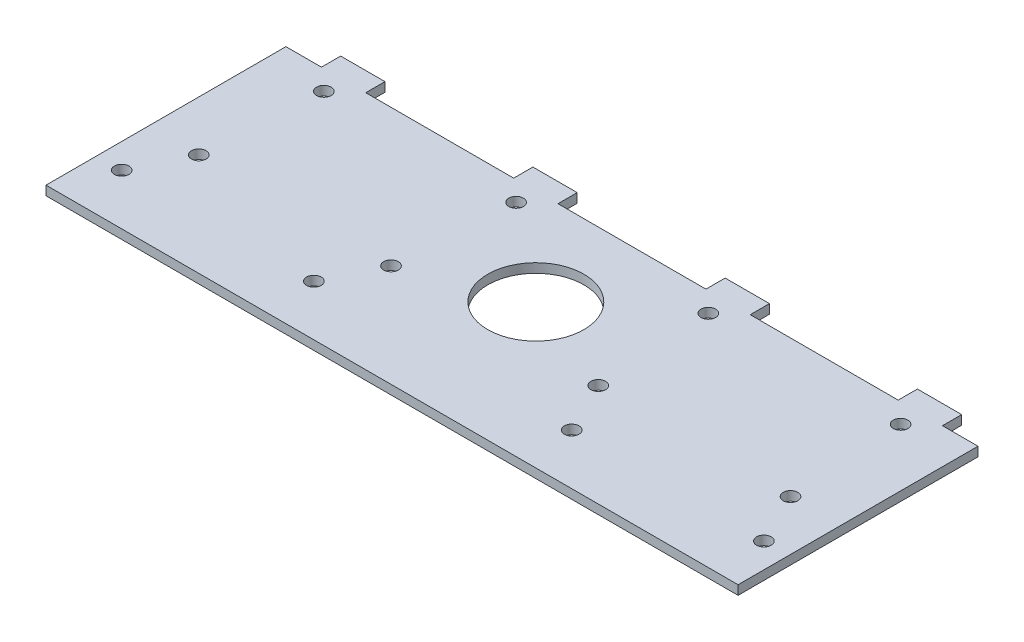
ISO-10303-21;
HEADER;
FILE_DESCRIPTION(('STEP AP214'),'2;1');
FILE_NAME('part.step','',(''),(''),'','','');
FILE_SCHEMA(('AUTOMOTIVE_DESIGN { 1 0 10303 214 1 1 1 1 }'));
ENDSEC;
DATA;
#1=APPLICATION_CONTEXT('core data for automotive mechanical design processes');
#2=APPLICATION_PROTOCOL_DEFINITION('international standard','automotive_design',2000,#1);
#3=PRODUCT_CONTEXT('',#1,'mechanical');
#4=PRODUCT('Part','Part','',(#3));
#5=PRODUCT_RELATED_PRODUCT_CATEGORY('part','',(#4));
#6=PRODUCT_DEFINITION_FORMATION('','',#4);
#7=PRODUCT_DEFINITION_CONTEXT('part definition',#1,'design');
#8=PRODUCT_DEFINITION('design','',#6,#7);
#9=PRODUCT_DEFINITION_SHAPE('','',#8);
#10=(LENGTH_UNIT() NAMED_UNIT(*) SI_UNIT(.MILLI.,.METRE.));
#11=(NAMED_UNIT(*) PLANE_ANGLE_UNIT() SI_UNIT($,.RADIAN.));
#12=(NAMED_UNIT(*) SI_UNIT($,.STERADIAN.) SOLID_ANGLE_UNIT());
#13=UNCERTAINTY_MEASURE_WITH_UNIT(LENGTH_MEASURE(1.E-05),#10,'distance_accuracy_value','');
#14=(GEOMETRIC_REPRESENTATION_CONTEXT(3) GLOBAL_UNCERTAINTY_ASSIGNED_CONTEXT((#13)) GLOBAL_UNIT_ASSIGNED_CONTEXT((#10,
#11,#12)) REPRESENTATION_CONTEXT('',''));
#15=CARTESIAN_POINT('',(0.,0.,0.));
#16=DIRECTION('',(0.,0.,1.));
#17=DIRECTION('',(1.,0.,0.));
#18=AXIS2_PLACEMENT_3D('',#15,#16,#17);
#19=CARTESIAN_POINT('',(0.,-1.524,0.));
#20=DIRECTION('',(0.,-1.,0.));
#21=DIRECTION('',(0.,0.,-1.));
#22=AXIS2_PLACEMENT_3D('',#19,#20,#21);
#23=PLANE('',#22);
#24=CARTESIAN_POINT('',(-15.875,-1.524,-14.963312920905));
#25=DIRECTION('',(0.,1.,0.));
#26=DIRECTION('',(0.,0.,1.));
#27=AXIS2_PLACEMENT_3D('',#24,#25,#26);
#28=CIRCLE('',#27,1.2065);
#29=CARTESIAN_POINT('',(-15.875,-1.524,-13.756812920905));
#30=VERTEX_POINT('',#29);
#31=EDGE_CURVE('E554',#30,#30,#28,.T.);
#32=ORIENTED_EDGE('',*,*,#31,.T.);
#33=EDGE_LOOP('',(#32));
#34=FACE_BOUND('',#33,.T.);
#35=CARTESIAN_POINT('',(-47.625,-1.524,-14.963312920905));
#36=DIRECTION('',(0.,1.,0.));
#37=DIRECTION('',(0.,0.,1.));
#38=AXIS2_PLACEMENT_3D('',#35,#36,#37);
#39=CIRCLE('',#38,1.2065);
#40=CARTESIAN_POINT('',(-47.625,-1.524,-13.756812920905));
#41=VERTEX_POINT('',#40);
#42=EDGE_CURVE('E543',#41,#41,#39,.T.);
#43=ORIENTED_EDGE('',*,*,#42,.T.);
#44=EDGE_LOOP('',(#43));
#45=FACE_BOUND('',#44,.T.);
#46=CARTESIAN_POINT('',(53.0352,-1.524,13.0175));
#47=DIRECTION('',(0.,-1.,0.));
#48=DIRECTION('',(0.,0.,1.));
#49=AXIS2_PLACEMENT_3D('',#46,#47,#48);
#50=CIRCLE('',#49,1.2065);
#51=CARTESIAN_POINT('',(53.0352,-1.524,14.224));
#52=VERTEX_POINT('',#51);
#53=EDGE_CURVE('E531',#52,#52,#50,.T.);
#54=ORIENTED_EDGE('',*,*,#53,.F.);
#55=EDGE_LOOP('',(#54));
#56=FACE_BOUND('',#55,.T.);
#57=CARTESIAN_POINT('',(21.2852,-1.524,13.0175));
#58=DIRECTION('',(0.,-1.,0.));
#59=DIRECTION('',(0.,0.,1.));
#60=AXIS2_PLACEMENT_3D('',#57,#58,#59);
#61=CIRCLE('',#60,1.2065);
#62=CARTESIAN_POINT('',(21.2852,-1.524,14.224));
#63=VERTEX_POINT('',#62);
#64=EDGE_CURVE('E519',#63,#63,#61,.T.);
#65=ORIENTED_EDGE('',*,*,#64,.F.);
#66=EDGE_LOOP('',(#65));
#67=FACE_BOUND('',#66,.T.);
#68=CARTESIAN_POINT('',(-48.8640497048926,-1.524,4.45437380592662));
#69=DIRECTION('',(0.,1.,0.));
#70=DIRECTION('',(0.,0.,1.));
#71=AXIS2_PLACEMENT_3D('',#68,#69,#70);
#72=CIRCLE('',#71,1.2065);
#73=CARTESIAN_POINT('',(-48.8640497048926,-1.524,5.66087380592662));
#74=VERTEX_POINT('',#73);
#75=EDGE_CURVE('E513',#74,#74,#72,.T.);
#76=ORIENTED_EDGE('',*,*,#75,.T.);
#77=EDGE_LOOP('',(#76));
#78=FACE_BOUND('',#77,.T.);
#79=CARTESIAN_POINT('',(-53.0352,-1.524,13.0175));
#80=DIRECTION('',(0.,1.,0.));
#81=DIRECTION('',(0.,0.,1.));
#82=AXIS2_PLACEMENT_3D('',#79,#80,#81);
#83=CIRCLE('',#82,1.2065);
#84=CARTESIAN_POINT('',(-53.0352,-1.524,14.224));
#85=VERTEX_POINT('',#84);
#86=EDGE_CURVE('E507',#85,#85,#83,.T.);
#87=ORIENTED_EDGE('',*,*,#86,.T.);
#88=EDGE_LOOP('',(#87));
#89=FACE_BOUND('',#88,.T.);
#90=CARTESIAN_POINT('',(-17.1140497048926,-1.524,4.45437380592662));
#91=DIRECTION('',(0.,1.,0.));
#92=DIRECTION('',(0.,0.,1.));
#93=AXIS2_PLACEMENT_3D('',#90,#91,#92);
#94=CIRCLE('',#93,1.2065);
#95=CARTESIAN_POINT('',(-17.1140497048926,-1.524,5.66087380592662));
#96=VERTEX_POINT('',#95);
#97=EDGE_CURVE('E501',#96,#96,#94,.T.);
#98=ORIENTED_EDGE('',*,*,#97,.T.);
#99=EDGE_LOOP('',(#98));
#100=FACE_BOUND('',#99,.T.);
#101=CARTESIAN_POINT('',(-21.2852,-1.524,13.0175));
#102=DIRECTION('',(0.,1.,0.));
#103=DIRECTION('',(0.,0.,1.));
#104=AXIS2_PLACEMENT_3D('',#101,#102,#103);
#105=CIRCLE('',#104,1.2065);
#106=CARTESIAN_POINT('',(-21.2852,-1.524,14.224));
#107=VERTEX_POINT('',#106);
#108=EDGE_CURVE('E496',#107,#107,#105,.T.);
#109=ORIENTED_EDGE('',*,*,#108,.T.);
#110=EDGE_LOOP('',(#109));
#111=FACE_BOUND('',#110,.T.);
#112=DIRECTION('',(0.,0.,-1.));
#113=VECTOR('',#112,1.);
#114=CARTESIAN_POINT('',(-51.2826,-1.524,-21.3995));
#115=LINE('',#114,#113);
#116=CARTESIAN_POINT('',(-51.2826,-1.524,-18.2245));
#117=VERTEX_POINT('',#116);
#118=CARTESIAN_POINT('',(-51.2826,-1.524,-21.3995));
#119=VERTEX_POINT('',#118);
#120=EDGE_CURVE('E179',#117,#119,#115,.T.);
#121=ORIENTED_EDGE('',*,*,#120,.T.);
#122=DIRECTION('',(-1.,0.,0.));
#123=VECTOR('',#122,1.);
#124=CARTESIAN_POINT('',(-57.15,-1.524,-21.3995));
#125=LINE('',#124,#123);
#126=CARTESIAN_POINT('',(-43.9674,-1.524,-21.3995));
#127=VERTEX_POINT('',#126);
#128=EDGE_CURVE('E194',#127,#119,#125,.T.);
#129=ORIENTED_EDGE('',*,*,#128,.F.);
#130=DIRECTION('',(0.,0.,1.));
#131=VECTOR('',#130,1.);
#132=CARTESIAN_POINT('',(-43.9674,-1.524,-21.3995));
#133=LINE('',#132,#131);
#134=CARTESIAN_POINT('',(-43.9674,-1.524,-18.2245));
#135=VERTEX_POINT('',#134);
#136=EDGE_CURVE('E489',#127,#135,#133,.T.);
#137=ORIENTED_EDGE('',*,*,#136,.T.);
#138=DIRECTION('',(1.,0.,0.));
#139=VECTOR('',#138,1.);
#140=CARTESIAN_POINT('',(-43.9674,-1.524,-18.2245));
#141=LINE('',#140,#139);
#142=CARTESIAN_POINT('',(-19.5326,-1.524,-18.2245));
#143=VERTEX_POINT('',#142);
#144=EDGE_CURVE('E474',#135,#143,#141,.T.);
#145=ORIENTED_EDGE('',*,*,#144,.T.);
#146=DIRECTION('',(0.,0.,-1.));
#147=VECTOR('',#146,1.);
#148=CARTESIAN_POINT('',(-19.5326,-1.524,-21.3995));
#149=LINE('',#148,#147);
#150=CARTESIAN_POINT('',(-19.5326,-1.524,-21.3995));
#151=VERTEX_POINT('',#150);
#152=EDGE_CURVE('E482',#143,#151,#149,.T.);
#153=ORIENTED_EDGE('',*,*,#152,.T.);
#154=CARTESIAN_POINT('',(-12.2174,-1.524,-21.3995));
#155=VERTEX_POINT('',#154);
#156=EDGE_CURVE('E198',#155,#151,#125,.T.);
#157=ORIENTED_EDGE('',*,*,#156,.F.);
#158=DIRECTION('',(0.,0.,1.));
#159=VECTOR('',#158,1.);
#160=CARTESIAN_POINT('',(-12.2174,-1.524,-21.3995));
#161=LINE('',#160,#159);
#162=CARTESIAN_POINT('',(-12.2174,-1.524,-18.2245));
#163=VERTEX_POINT('',#162);
#164=EDGE_CURVE('E423',#155,#163,#161,.T.);
#165=ORIENTED_EDGE('',*,*,#164,.T.);
#166=DIRECTION('',(1.,0.,0.));
#167=VECTOR('',#166,1.);
#168=CARTESIAN_POINT('',(-12.2174,-1.524,-18.2245));
#169=LINE('',#168,#167);
#170=CARTESIAN_POINT('',(12.2174,-1.524,-18.2245));
#171=VERTEX_POINT('',#170);
#172=EDGE_CURVE('E407',#163,#171,#169,.T.);
#173=ORIENTED_EDGE('',*,*,#172,.T.);
#174=DIRECTION('',(0.,0.,-1.));
#175=VECTOR('',#174,1.);
#176=CARTESIAN_POINT('',(12.2174,-1.524,-21.3995));
#177=LINE('',#176,#175);
#178=CARTESIAN_POINT('',(12.2174,-1.524,-21.3995));
#179=VERTEX_POINT('',#178);
#180=EDGE_CURVE('E413',#171,#179,#177,.T.);
#181=ORIENTED_EDGE('',*,*,#180,.T.);
#182=CARTESIAN_POINT('',(19.5326,-1.524,-21.3995));
#183=VERTEX_POINT('',#182);
#184=EDGE_CURVE('E201',#183,#179,#125,.T.);
#185=ORIENTED_EDGE('',*,*,#184,.F.);
#186=DIRECTION('',(0.,0.,1.));
#187=VECTOR('',#186,1.);
#188=CARTESIAN_POINT('',(19.5326,-1.524,-21.3995));
#189=LINE('',#188,#187);
#190=CARTESIAN_POINT('',(19.5326,-1.524,-18.2245));
#191=VERTEX_POINT('',#190);
#192=EDGE_CURVE('E449',#183,#191,#189,.T.);
#193=ORIENTED_EDGE('',*,*,#192,.T.);
#194=DIRECTION('',(1.,0.,0.));
#195=VECTOR('',#194,1.);
#196=CARTESIAN_POINT('',(19.5326,-1.524,-18.2245));
#197=LINE('',#196,#195);
#198=CARTESIAN_POINT('',(43.9674,-1.524,-18.2245));
#199=VERTEX_POINT('',#198);
#200=EDGE_CURVE('E431',#191,#199,#197,.T.);
#201=ORIENTED_EDGE('',*,*,#200,.T.);
#202=DIRECTION('',(0.,0.,-1.));
#203=VECTOR('',#202,1.);
#204=CARTESIAN_POINT('',(43.9674,-1.524,-21.3995));
#205=LINE('',#204,#203);
#206=CARTESIAN_POINT('',(43.9674,-1.524,-21.3995));
#207=VERTEX_POINT('',#206);
#208=EDGE_CURVE('E439',#199,#207,#205,.T.);
#209=ORIENTED_EDGE('',*,*,#208,.T.);
#210=CARTESIAN_POINT('',(51.2826,-1.524,-21.3995));
#211=VERTEX_POINT('',#210);
#212=EDGE_CURVE('E202',#211,#207,#125,.T.);
#213=ORIENTED_EDGE('',*,*,#212,.F.);
#214=DIRECTION('',(0.,0.,1.));
#215=VECTOR('',#214,1.);
#216=CARTESIAN_POINT('',(51.2826,-1.524,-21.3995));
#217=LINE('',#216,#215);
#218=CARTESIAN_POINT('',(51.2826,-1.524,-18.2245));
#219=VERTEX_POINT('',#218);
#220=EDGE_CURVE('E462',#211,#219,#217,.T.);
#221=ORIENTED_EDGE('',*,*,#220,.T.);
#222=DIRECTION('',(1.,0.,0.));
#223=VECTOR('',#222,1.);
#224=CARTESIAN_POINT('',(51.2826,-1.524,-18.2245));
#225=LINE('',#224,#223);
#226=CARTESIAN_POINT('',(57.15,-1.524,-18.2245));
#227=VERTEX_POINT('',#226);
#228=EDGE_CURVE('E458',#219,#227,#225,.T.);
#229=ORIENTED_EDGE('',*,*,#228,.T.);
#230=DIRECTION('',(0.,0.,-1.));
#231=VECTOR('',#230,1.);
#232=CARTESIAN_POINT('',(57.15,-1.524,21.3995));
#233=LINE('',#232,#231);
#234=CARTESIAN_POINT('',(57.15,-1.524,21.3995));
#235=VERTEX_POINT('',#234);
#236=EDGE_CURVE('E199',#235,#227,#233,.T.);
#237=ORIENTED_EDGE('',*,*,#236,.F.);
#238=DIRECTION('',(1.,0.,0.));
#239=VECTOR('',#238,1.);
#240=CARTESIAN_POINT('',(-57.15,-1.524,21.3995));
#241=LINE('',#240,#239);
#242=CARTESIAN_POINT('',(-57.15,-1.524,21.3995));
#243=VERTEX_POINT('',#242);
#244=EDGE_CURVE('E214',#243,#235,#241,.T.);
#245=ORIENTED_EDGE('',*,*,#244,.F.);
#246=DIRECTION('',(0.,0.,1.));
#247=VECTOR('',#246,1.);
#248=CARTESIAN_POINT('',(-57.15,-1.524,21.3995));
#249=LINE('',#248,#247);
#250=CARTESIAN_POINT('',(-57.15,-1.524,-18.2245));
#251=VERTEX_POINT('',#250);
#252=EDGE_CURVE('E208',#251,#243,#249,.T.);
#253=ORIENTED_EDGE('',*,*,#252,.F.);
#254=DIRECTION('',(1.,0.,0.));
#255=VECTOR('',#254,1.);
#256=CARTESIAN_POINT('',(-75.7174,-1.524,-18.2245));
#257=LINE('',#256,#255);
#258=EDGE_CURVE('E188',#251,#117,#257,.T.);
#259=ORIENTED_EDGE('',*,*,#258,.T.);
#260=EDGE_LOOP('',(#121,#129,#137,#145,#153,#157,#165,#173,#181,#185,#193,#201,#209,#213,#221,
#229,#237,#245,#253,#259));
#261=FACE_BOUND('',#260,.T.);
#262=CARTESIAN_POINT('',(0.,-1.524,-2.3495));
#263=DIRECTION('',(0.,1.,0.));
#264=DIRECTION('',(0.,0.,1.));
#265=AXIS2_PLACEMENT_3D('',#262,#263,#264);
#266=CIRCLE('',#265,7.9375);
#267=CARTESIAN_POINT('',(0.,-1.524,5.588));
#268=VERTEX_POINT('',#267);
#269=EDGE_CURVE('E226',#268,#268,#266,.T.);
#270=ORIENTED_EDGE('',*,*,#269,.T.);
#271=EDGE_LOOP('',(#270));
#272=FACE_BOUND('',#271,.T.);
#273=CARTESIAN_POINT('',(17.1140497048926,-1.524,4.45437380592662));
#274=DIRECTION('',(0.,-1.,0.));
#275=DIRECTION('',(0.,0.,1.));
#276=AXIS2_PLACEMENT_3D('',#273,#274,#275);
#277=CIRCLE('',#276,1.2065);
#278=CARTESIAN_POINT('',(17.1140497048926,-1.524,5.66087380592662));
#279=VERTEX_POINT('',#278);
#280=EDGE_CURVE('E525',#279,#279,#277,.T.);
#281=ORIENTED_EDGE('',*,*,#280,.F.);
#282=EDGE_LOOP('',(#281));
#283=FACE_BOUND('',#282,.T.);
#284=CARTESIAN_POINT('',(48.8640497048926,-1.524,4.45437380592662));
#285=DIRECTION('',(0.,-1.,0.));
#286=DIRECTION('',(0.,0.,1.));
#287=AXIS2_PLACEMENT_3D('',#284,#285,#286);
#288=CIRCLE('',#287,1.2065);
#289=CARTESIAN_POINT('',(48.8640497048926,-1.524,5.66087380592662));
#290=VERTEX_POINT('',#289);
#291=EDGE_CURVE('E537',#290,#290,#288,.T.);
#292=ORIENTED_EDGE('',*,*,#291,.F.);
#293=EDGE_LOOP('',(#292));
#294=FACE_BOUND('',#293,.T.);
#295=CARTESIAN_POINT('',(15.875,-1.524,-14.963312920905));
#296=DIRECTION('',(0.,1.,0.));
#297=DIRECTION('',(0.,0.,1.));
#298=AXIS2_PLACEMENT_3D('',#295,#296,#297);
#299=CIRCLE('',#298,1.2065);
#300=CARTESIAN_POINT('',(15.875,-1.524,-13.756812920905));
#301=VERTEX_POINT('',#300);
#302=EDGE_CURVE('E240',#301,#301,#299,.T.);
#303=ORIENTED_EDGE('',*,*,#302,.T.);
#304=EDGE_LOOP('',(#303));
#305=FACE_BOUND('',#304,.T.);
#306=CARTESIAN_POINT('',(47.625,-1.524,-14.963312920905));
#307=DIRECTION('',(0.,1.,0.));
#308=DIRECTION('',(0.,0.,1.));
#309=AXIS2_PLACEMENT_3D('',#306,#307,#308);
#310=CIRCLE('',#309,1.2065);
#311=CARTESIAN_POINT('',(47.625,-1.524,-13.756812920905));
#312=VERTEX_POINT('',#311);
#313=EDGE_CURVE('E45',#312,#312,#310,.T.);
#314=ORIENTED_EDGE('',*,*,#313,.T.);
#315=EDGE_LOOP('',(#314));
#316=FACE_BOUND('',#315,.T.);
#317=ADVANCED_FACE('F37',(#34,#45,#56,#67,#78,#89,#100,#111,#261,#272,#283,#294,#305,#316),#23,.T.);
#318=CARTESIAN_POINT('',(0.,0.,0.));
#319=DIRECTION('',(0.,-1.,0.));
#320=DIRECTION('',(0.,0.,-1.));
#321=AXIS2_PLACEMENT_3D('',#318,#319,#320);
#322=PLANE('',#321);
#323=CARTESIAN_POINT('',(-15.875,0.,-14.963312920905));
#324=DIRECTION('',(0.,1.,0.));
#325=DIRECTION('',(0.,0.,1.));
#326=AXIS2_PLACEMENT_3D('',#323,#324,#325);
#327=CIRCLE('',#326,1.2065);
#328=CARTESIAN_POINT('',(-15.875,0.,-13.756812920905));
#329=VERTEX_POINT('',#328);
#330=EDGE_CURVE('E549',#329,#329,#327,.T.);
#331=ORIENTED_EDGE('',*,*,#330,.F.);
#332=EDGE_LOOP('',(#331));
#333=FACE_BOUND('',#332,.T.);
#334=CARTESIAN_POINT('',(-47.625,0.,-14.963312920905));
#335=DIRECTION('',(0.,1.,0.));
#336=DIRECTION('',(0.,0.,1.));
#337=AXIS2_PLACEMENT_3D('',#334,#335,#336);
#338=CIRCLE('',#337,1.2065);
#339=CARTESIAN_POINT('',(-47.625,0.,-13.756812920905));
#340=VERTEX_POINT('',#339);
#341=EDGE_CURVE('E546',#340,#340,#338,.T.);
#342=ORIENTED_EDGE('',*,*,#341,.F.);
#343=EDGE_LOOP('',(#342));
#344=FACE_BOUND('',#343,.T.);
#345=CARTESIAN_POINT('',(53.0352,0.,13.0175));
#346=DIRECTION('',(0.,-1.,0.));
#347=DIRECTION('',(0.,0.,1.));
#348=AXIS2_PLACEMENT_3D('',#345,#346,#347);
#349=CIRCLE('',#348,1.2065);
#350=CARTESIAN_POINT('',(53.0352,0.,14.224));
#351=VERTEX_POINT('',#350);
#352=EDGE_CURVE('E534',#351,#351,#349,.T.);
#353=ORIENTED_EDGE('',*,*,#352,.T.);
#354=EDGE_LOOP('',(#353));
#355=FACE_BOUND('',#354,.T.);
#356=CARTESIAN_POINT('',(21.2852,0.,13.0175));
#357=DIRECTION('',(0.,-1.,0.));
#358=DIRECTION('',(0.,0.,1.));
#359=AXIS2_PLACEMENT_3D('',#356,#357,#358);
#360=CIRCLE('',#359,1.2065);
#361=CARTESIAN_POINT('',(21.2852,0.,14.224));
#362=VERTEX_POINT('',#361);
#363=EDGE_CURVE('E522',#362,#362,#360,.T.);
#364=ORIENTED_EDGE('',*,*,#363,.T.);
#365=EDGE_LOOP('',(#364));
#366=FACE_BOUND('',#365,.T.);
#367=CARTESIAN_POINT('',(-48.8640497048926,0.,4.45437380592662));
#368=DIRECTION('',(0.,1.,0.));
#369=DIRECTION('',(0.,0.,1.));
#370=AXIS2_PLACEMENT_3D('',#367,#368,#369);
#371=CIRCLE('',#370,1.2065);
#372=CARTESIAN_POINT('',(-48.8640497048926,0.,5.66087380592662));
#373=VERTEX_POINT('',#372);
#374=EDGE_CURVE('E516',#373,#373,#371,.T.);
#375=ORIENTED_EDGE('',*,*,#374,.F.);
#376=EDGE_LOOP('',(#375));
#377=FACE_BOUND('',#376,.T.);
#378=CARTESIAN_POINT('',(-53.0352,0.,13.0175));
#379=DIRECTION('',(0.,1.,0.));
#380=DIRECTION('',(0.,0.,1.));
#381=AXIS2_PLACEMENT_3D('',#378,#379,#380);
#382=CIRCLE('',#381,1.2065);
#383=CARTESIAN_POINT('',(-53.0352,0.,14.224));
#384=VERTEX_POINT('',#383);
#385=EDGE_CURVE('E510',#384,#384,#382,.T.);
#386=ORIENTED_EDGE('',*,*,#385,.F.);
#387=EDGE_LOOP('',(#386));
#388=FACE_BOUND('',#387,.T.);
#389=CARTESIAN_POINT('',(-17.1140497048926,0.,4.45437380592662));
#390=DIRECTION('',(0.,1.,0.));
#391=DIRECTION('',(0.,0.,1.));
#392=AXIS2_PLACEMENT_3D('',#389,#390,#391);
#393=CIRCLE('',#392,1.2065);
#394=CARTESIAN_POINT('',(-17.1140497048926,0.,5.66087380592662));
#395=VERTEX_POINT('',#394);
#396=EDGE_CURVE('E504',#395,#395,#393,.T.);
#397=ORIENTED_EDGE('',*,*,#396,.F.);
#398=EDGE_LOOP('',(#397));
#399=FACE_BOUND('',#398,.T.);
#400=CARTESIAN_POINT('',(-21.2852,0.,13.0175));
#401=DIRECTION('',(0.,1.,0.));
#402=DIRECTION('',(0.,0.,1.));
#403=AXIS2_PLACEMENT_3D('',#400,#401,#402);
#404=CIRCLE('',#403,1.2065);
#405=CARTESIAN_POINT('',(-21.2852,0.,14.224));
#406=VERTEX_POINT('',#405);
#407=EDGE_CURVE('E498',#406,#406,#404,.T.);
#408=ORIENTED_EDGE('',*,*,#407,.F.);
#409=EDGE_LOOP('',(#408));
#410=FACE_BOUND('',#409,.T.);
#411=CARTESIAN_POINT('',(0.,0.,-2.3495));
#412=DIRECTION('',(0.,1.,0.));
#413=DIRECTION('',(0.,0.,1.));
#414=AXIS2_PLACEMENT_3D('',#411,#412,#413);
#415=CIRCLE('',#414,7.9375);
#416=CARTESIAN_POINT('',(0.,0.,5.588));
#417=VERTEX_POINT('',#416);
#418=EDGE_CURVE('E395',#417,#417,#415,.T.);
#419=ORIENTED_EDGE('',*,*,#418,.F.);
#420=EDGE_LOOP('',(#419));
#421=FACE_BOUND('',#420,.T.);
#422=DIRECTION('',(-1.,0.,0.));
#423=VECTOR('',#422,1.);
#424=CARTESIAN_POINT('',(-57.15,0.,-21.3995));
#425=LINE('',#424,#423);
#426=CARTESIAN_POINT('',(-43.9674,0.,-21.3995));
#427=VERTEX_POINT('',#426);
#428=CARTESIAN_POINT('',(-51.2826,0.,-21.3995));
#429=VERTEX_POINT('',#428);
#430=EDGE_CURVE('E225',#427,#429,#425,.T.);
#431=ORIENTED_EDGE('',*,*,#430,.T.);
#432=DIRECTION('',(0.,0.,-1.));
#433=VECTOR('',#432,1.);
#434=CARTESIAN_POINT('',(-51.2826,0.,-21.3995));
#435=LINE('',#434,#433);
#436=CARTESIAN_POINT('',(-51.2826,0.,-18.2245));
#437=VERTEX_POINT('',#436);
#438=EDGE_CURVE('E182',#437,#429,#435,.T.);
#439=ORIENTED_EDGE('',*,*,#438,.F.);
#440=DIRECTION('',(-1.,0.,0.));
#441=VECTOR('',#440,1.);
#442=CARTESIAN_POINT('',(0.,0.,-18.2245));
#443=LINE('',#442,#441);
#444=CARTESIAN_POINT('',(-57.15,0.,-18.2245));
#445=VERTEX_POINT('',#444);
#446=EDGE_CURVE('E237',#437,#445,#443,.T.);
#447=ORIENTED_EDGE('',*,*,#446,.T.);
#448=DIRECTION('',(0.,0.,1.));
#449=VECTOR('',#448,1.);
#450=CARTESIAN_POINT('',(-57.15,0.,21.3995));
#451=LINE('',#450,#449);
#452=CARTESIAN_POINT('',(-57.15,0.,21.3995));
#453=VERTEX_POINT('',#452);
#454=EDGE_CURVE('E229',#445,#453,#451,.T.);
#455=ORIENTED_EDGE('',*,*,#454,.T.);
#456=DIRECTION('',(1.,0.,0.));
#457=VECTOR('',#456,1.);
#458=CARTESIAN_POINT('',(-57.15,0.,21.3995));
#459=LINE('',#458,#457);
#460=CARTESIAN_POINT('',(57.15,0.,21.3995));
#461=VERTEX_POINT('',#460);
#462=EDGE_CURVE('E205',#453,#461,#459,.T.);
#463=ORIENTED_EDGE('',*,*,#462,.T.);
#464=DIRECTION('',(0.,0.,-1.));
#465=VECTOR('',#464,1.);
#466=CARTESIAN_POINT('',(57.15,0.,21.3995));
#467=LINE('',#466,#465);
#468=CARTESIAN_POINT('',(57.15,0.,-18.2245));
#469=VERTEX_POINT('',#468);
#470=EDGE_CURVE('E222',#461,#469,#467,.T.);
#471=ORIENTED_EDGE('',*,*,#470,.T.);
#472=DIRECTION('',(1.,0.,0.));
#473=VECTOR('',#472,1.);
#474=CARTESIAN_POINT('',(51.2826,0.,-18.2245));
#475=LINE('',#474,#473);
#476=CARTESIAN_POINT('',(51.2826,0.,-18.2245));
#477=VERTEX_POINT('',#476);
#478=EDGE_CURVE('E460',#477,#469,#475,.T.);
#479=ORIENTED_EDGE('',*,*,#478,.F.);
#480=DIRECTION('',(0.,0.,1.));
#481=VECTOR('',#480,1.);
#482=CARTESIAN_POINT('',(51.2826,0.,-21.3995));
#483=LINE('',#482,#481);
#484=CARTESIAN_POINT('',(51.2826,0.,-21.3995));
#485=VERTEX_POINT('',#484);
#486=EDGE_CURVE('E463',#485,#477,#483,.T.);
#487=ORIENTED_EDGE('',*,*,#486,.F.);
#488=CARTESIAN_POINT('',(43.9674,0.,-21.3995));
#489=VERTEX_POINT('',#488);
#490=EDGE_CURVE('E227',#485,#489,#425,.T.);
#491=ORIENTED_EDGE('',*,*,#490,.T.);
#492=DIRECTION('',(0.,0.,-1.));
#493=VECTOR('',#492,1.);
#494=CARTESIAN_POINT('',(43.9674,0.,-21.3995));
#495=LINE('',#494,#493);
#496=CARTESIAN_POINT('',(43.9674,0.,-18.2245));
#497=VERTEX_POINT('',#496);
#498=EDGE_CURVE('E443',#497,#489,#495,.T.);
#499=ORIENTED_EDGE('',*,*,#498,.F.);
#500=DIRECTION('',(1.,0.,0.));
#501=VECTOR('',#500,1.);
#502=CARTESIAN_POINT('',(19.5326,0.,-18.2245));
#503=LINE('',#502,#501);
#504=CARTESIAN_POINT('',(19.5326,0.,-18.2245));
#505=VERTEX_POINT('',#504);
#506=EDGE_CURVE('E436',#505,#497,#503,.T.);
#507=ORIENTED_EDGE('',*,*,#506,.F.);
#508=DIRECTION('',(0.,0.,1.));
#509=VECTOR('',#508,1.);
#510=CARTESIAN_POINT('',(19.5326,0.,-21.3995));
#511=LINE('',#510,#509);
#512=CARTESIAN_POINT('',(19.5326,0.,-21.3995));
#513=VERTEX_POINT('',#512);
#514=EDGE_CURVE('E440',#513,#505,#511,.T.);
#515=ORIENTED_EDGE('',*,*,#514,.F.);
#516=CARTESIAN_POINT('',(12.2174,0.,-21.3995));
#517=VERTEX_POINT('',#516);
#518=EDGE_CURVE('E230',#513,#517,#425,.T.);
#519=ORIENTED_EDGE('',*,*,#518,.T.);
#520=DIRECTION('',(0.,0.,-1.));
#521=VECTOR('',#520,1.);
#522=CARTESIAN_POINT('',(12.2174,0.,-21.3995));
#523=LINE('',#522,#521);
#524=CARTESIAN_POINT('',(12.2174,0.,-18.2245));
#525=VERTEX_POINT('',#524);
#526=EDGE_CURVE('E417',#525,#517,#523,.T.);
#527=ORIENTED_EDGE('',*,*,#526,.F.);
#528=DIRECTION('',(1.,0.,0.));
#529=VECTOR('',#528,1.);
#530=CARTESIAN_POINT('',(-12.2174,0.,-18.2245));
#531=LINE('',#530,#529);
#532=CARTESIAN_POINT('',(-12.2174,0.,-18.2245));
#533=VERTEX_POINT('',#532);
#534=EDGE_CURVE('E410',#533,#525,#531,.T.);
#535=ORIENTED_EDGE('',*,*,#534,.F.);
#536=DIRECTION('',(0.,0.,1.));
#537=VECTOR('',#536,1.);
#538=CARTESIAN_POINT('',(-12.2174,0.,-21.3995));
#539=LINE('',#538,#537);
#540=CARTESIAN_POINT('',(-12.2174,0.,-21.3995));
#541=VERTEX_POINT('',#540);
#542=EDGE_CURVE('E414',#541,#533,#539,.T.);
#543=ORIENTED_EDGE('',*,*,#542,.F.);
#544=CARTESIAN_POINT('',(-19.5326,0.,-21.3995));
#545=VERTEX_POINT('',#544);
#546=EDGE_CURVE('E231',#541,#545,#425,.T.);
#547=ORIENTED_EDGE('',*,*,#546,.T.);
#548=DIRECTION('',(0.,0.,-1.));
#549=VECTOR('',#548,1.);
#550=CARTESIAN_POINT('',(-19.5326,0.,-21.3995));
#551=LINE('',#550,#549);
#552=CARTESIAN_POINT('',(-19.5326,0.,-18.2245));
#553=VERTEX_POINT('',#552);
#554=EDGE_CURVE('E485',#553,#545,#551,.T.);
#555=ORIENTED_EDGE('',*,*,#554,.F.);
#556=DIRECTION('',(1.,0.,0.));
#557=VECTOR('',#556,1.);
#558=CARTESIAN_POINT('',(-43.9674,0.,-18.2245));
#559=LINE('',#558,#557);
#560=CARTESIAN_POINT('',(-43.9674,0.,-18.2245));
#561=VERTEX_POINT('',#560);
#562=EDGE_CURVE('E479',#561,#553,#559,.T.);
#563=ORIENTED_EDGE('',*,*,#562,.F.);
#564=DIRECTION('',(0.,0.,1.));
#565=VECTOR('',#564,1.);
#566=CARTESIAN_POINT('',(-43.9674,0.,-21.3995));
#567=LINE('',#566,#565);
#568=EDGE_CURVE('E483',#427,#561,#567,.T.);
#569=ORIENTED_EDGE('',*,*,#568,.F.);
#570=EDGE_LOOP('',(#431,#439,#447,#455,#463,#471,#479,#487,#491,#499,#507,#515,#519,#527,#535,
#543,#547,#555,#563,#569));
#571=FACE_BOUND('',#570,.T.);
#572=CARTESIAN_POINT('',(17.1140497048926,0.,4.45437380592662));
#573=DIRECTION('',(0.,-1.,0.));
#574=DIRECTION('',(0.,0.,1.));
#575=AXIS2_PLACEMENT_3D('',#572,#573,#574);
#576=CIRCLE('',#575,1.2065);
#577=CARTESIAN_POINT('',(17.1140497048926,0.,5.66087380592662));
#578=VERTEX_POINT('',#577);
#579=EDGE_CURVE('E528',#578,#578,#576,.T.);
#580=ORIENTED_EDGE('',*,*,#579,.T.);
#581=EDGE_LOOP('',(#580));
#582=FACE_BOUND('',#581,.T.);
#583=CARTESIAN_POINT('',(48.8640497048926,0.,4.45437380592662));
#584=DIRECTION('',(0.,-1.,0.));
#585=DIRECTION('',(0.,0.,1.));
#586=AXIS2_PLACEMENT_3D('',#583,#584,#585);
#587=CIRCLE('',#586,1.2065);
#588=CARTESIAN_POINT('',(48.8640497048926,0.,5.66087380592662));
#589=VERTEX_POINT('',#588);
#590=EDGE_CURVE('E540',#589,#589,#587,.T.);
#591=ORIENTED_EDGE('',*,*,#590,.T.);
#592=EDGE_LOOP('',(#591));
#593=FACE_BOUND('',#592,.T.);
#594=CARTESIAN_POINT('',(15.875,0.,-14.963312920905));
#595=DIRECTION('',(0.,1.,0.));
#596=DIRECTION('',(0.,0.,1.));
#597=AXIS2_PLACEMENT_3D('',#594,#595,#596);
#598=CIRCLE('',#597,1.2065);
#599=CARTESIAN_POINT('',(15.875,0.,-13.756812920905));
#600=VERTEX_POINT('',#599);
#601=EDGE_CURVE('E243',#600,#600,#598,.T.);
#602=ORIENTED_EDGE('',*,*,#601,.F.);
#603=EDGE_LOOP('',(#602));
#604=FACE_BOUND('',#603,.T.);
#605=CARTESIAN_POINT('',(47.625,0.,-14.963312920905));
#606=DIRECTION('',(0.,1.,0.));
#607=DIRECTION('',(0.,0.,1.));
#608=AXIS2_PLACEMENT_3D('',#605,#606,#607);
#609=CIRCLE('',#608,1.2065);
#610=CARTESIAN_POINT('',(47.625,0.,-13.756812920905));
#611=VERTEX_POINT('',#610);
#612=EDGE_CURVE('E11',#611,#611,#609,.T.);
#613=ORIENTED_EDGE('',*,*,#612,.F.);
#614=EDGE_LOOP('',(#613));
#615=FACE_BOUND('',#614,.T.);
#616=ADVANCED_FACE('F254',(#333,#344,#355,#366,#377,#388,#399,#410,#421,#571,#582,#593,#604,
#615),#322,.F.);
#617=CARTESIAN_POINT('',(-57.15,-1.524,-21.3995));
#618=DIRECTION('',(0.,0.,-1.));
#619=DIRECTION('',(-1.,0.,0.));
#620=AXIS2_PLACEMENT_3D('',#617,#618,#619);
#621=PLANE('',#620);
#622=DIRECTION('',(0.,1.,0.));
#623=VECTOR('',#622,1.);
#624=CARTESIAN_POINT('',(-19.5326,-1.524,-21.3995));
#625=LINE('',#624,#623);
#626=EDGE_CURVE('E471',#151,#545,#625,.T.);
#627=ORIENTED_EDGE('',*,*,#626,.T.);
#628=ORIENTED_EDGE('',*,*,#546,.F.);
#629=DIRECTION('',(0.,1.,0.));
#630=VECTOR('',#629,1.);
#631=CARTESIAN_POINT('',(-12.2174,-1.524,-21.3995));
#632=LINE('',#631,#630);
#633=EDGE_CURVE('E406',#155,#541,#632,.T.);
#634=ORIENTED_EDGE('',*,*,#633,.F.);
#635=ORIENTED_EDGE('',*,*,#156,.T.);
#636=EDGE_LOOP('',(#627,#628,#634,#635));
#637=FACE_BOUND('',#636,.T.);
#638=ADVANCED_FACE('F256',(#637),#621,.T.);
#639=DIRECTION('',(0.,1.,0.));
#640=VECTOR('',#639,1.);
#641=CARTESIAN_POINT('',(51.2826,-1.524,-21.3995));
#642=LINE('',#641,#640);
#643=EDGE_CURVE('E456',#211,#485,#642,.T.);
#644=ORIENTED_EDGE('',*,*,#643,.F.);
#645=ORIENTED_EDGE('',*,*,#212,.T.);
#646=DIRECTION('',(0.,1.,0.));
#647=VECTOR('',#646,1.);
#648=CARTESIAN_POINT('',(43.9674,-1.524,-21.3995));
#649=LINE('',#648,#647);
#650=EDGE_CURVE('E428',#207,#489,#649,.T.);
#651=ORIENTED_EDGE('',*,*,#650,.T.);
#652=ORIENTED_EDGE('',*,*,#490,.F.);
#653=EDGE_LOOP('',(#644,#645,#651,#652));
#654=FACE_BOUND('',#653,.T.);
#655=ADVANCED_FACE('F263',(#654),#621,.T.);
#656=DIRECTION('',(0.,1.,0.));
#657=VECTOR('',#656,1.);
#658=CARTESIAN_POINT('',(19.5326,-1.524,-21.3995));
#659=LINE('',#658,#657);
#660=EDGE_CURVE('E430',#183,#513,#659,.T.);
#661=ORIENTED_EDGE('',*,*,#660,.F.);
#662=ORIENTED_EDGE('',*,*,#184,.T.);
#663=DIRECTION('',(0.,1.,0.));
#664=VECTOR('',#663,1.);
#665=CARTESIAN_POINT('',(12.2174,-1.524,-21.3995));
#666=LINE('',#665,#664);
#667=EDGE_CURVE('E403',#179,#517,#666,.T.);
#668=ORIENTED_EDGE('',*,*,#667,.T.);
#669=ORIENTED_EDGE('',*,*,#518,.F.);
#670=EDGE_LOOP('',(#661,#662,#668,#669));
#671=FACE_BOUND('',#670,.T.);
#672=ADVANCED_FACE('F282',(#671),#621,.T.);
#673=CARTESIAN_POINT('',(57.15,-1.524,21.3995));
#674=DIRECTION('',(1.,0.,0.));
#675=DIRECTION('',(0.,0.,-1.));
#676=AXIS2_PLACEMENT_3D('',#673,#674,#675);
#677=PLANE('',#676);
#678=DIRECTION('',(0.,-1.,0.));
#679=VECTOR('',#678,1.);
#680=CARTESIAN_POINT('',(57.15,-1.524,-18.2245));
#681=LINE('',#680,#679);
#682=EDGE_CURVE('E446',#469,#227,#681,.T.);
#683=ORIENTED_EDGE('',*,*,#682,.F.);
#684=ORIENTED_EDGE('',*,*,#470,.F.);
#685=DIRECTION('',(0.,1.,0.));
#686=VECTOR('',#685,1.);
#687=CARTESIAN_POINT('',(57.15,-1.524,21.3995));
#688=LINE('',#687,#686);
#689=EDGE_CURVE('E235',#235,#461,#688,.T.);
#690=ORIENTED_EDGE('',*,*,#689,.F.);
#691=ORIENTED_EDGE('',*,*,#236,.T.);
#692=EDGE_LOOP('',(#683,#684,#690,#691));
#693=FACE_BOUND('',#692,.T.);
#694=ADVANCED_FACE('F276',(#693),#677,.T.);
#695=CARTESIAN_POINT('',(-57.15,-1.524,21.3995));
#696=DIRECTION('',(0.,0.,1.));
#697=DIRECTION('',(1.,0.,0.));
#698=AXIS2_PLACEMENT_3D('',#695,#696,#697);
#699=PLANE('',#698);
#700=ORIENTED_EDGE('',*,*,#462,.F.);
#701=DIRECTION('',(0.,1.,0.));
#702=VECTOR('',#701,1.);
#703=CARTESIAN_POINT('',(-57.15,-1.524,21.3995));
#704=LINE('',#703,#702);
#705=EDGE_CURVE('E219',#243,#453,#704,.T.);
#706=ORIENTED_EDGE('',*,*,#705,.F.);
#707=ORIENTED_EDGE('',*,*,#244,.T.);
#708=ORIENTED_EDGE('',*,*,#689,.T.);
#709=EDGE_LOOP('',(#700,#706,#707,#708));
#710=FACE_BOUND('',#709,.T.);
#711=ADVANCED_FACE('F272',(#710),#699,.T.);
#712=CARTESIAN_POINT('',(-57.15,-1.524,21.3995));
#713=DIRECTION('',(-1.,0.,0.));
#714=DIRECTION('',(0.,0.,1.));
#715=AXIS2_PLACEMENT_3D('',#712,#713,#714);
#716=PLANE('',#715);
#717=DIRECTION('',(0.,1.,0.));
#718=VECTOR('',#717,1.);
#719=CARTESIAN_POINT('',(-57.15,-1.524,-18.2245));
#720=LINE('',#719,#718);
#721=EDGE_CURVE('E52',#251,#445,#720,.T.);
#722=ORIENTED_EDGE('',*,*,#721,.F.);
#723=ORIENTED_EDGE('',*,*,#252,.T.);
#724=ORIENTED_EDGE('',*,*,#705,.T.);
#725=ORIENTED_EDGE('',*,*,#454,.F.);
#726=EDGE_LOOP('',(#722,#723,#724,#725));
#727=FACE_BOUND('',#726,.T.);
#728=ADVANCED_FACE('F275',(#727),#716,.T.);
#729=DIRECTION('',(0.,1.,0.));
#730=VECTOR('',#729,1.);
#731=CARTESIAN_POINT('',(-51.2826,-1.524,-21.3995));
#732=LINE('',#731,#730);
#733=EDGE_CURVE('E175',#119,#429,#732,.T.);
#734=ORIENTED_EDGE('',*,*,#733,.T.);
#735=ORIENTED_EDGE('',*,*,#430,.F.);
#736=DIRECTION('',(0.,1.,0.));
#737=VECTOR('',#736,1.);
#738=CARTESIAN_POINT('',(-43.9674,-1.524,-21.3995));
#739=LINE('',#738,#737);
#740=EDGE_CURVE('E60',#127,#427,#739,.T.);
#741=ORIENTED_EDGE('',*,*,#740,.F.);
#742=ORIENTED_EDGE('',*,*,#128,.T.);
#743=EDGE_LOOP('',(#734,#735,#741,#742));
#744=FACE_BOUND('',#743,.T.);
#745=ADVANCED_FACE('F197',(#744),#621,.T.);
#746=CARTESIAN_POINT('',(0.,-1.524,-2.3495));
#747=DIRECTION('',(0.,1.,0.));
#748=DIRECTION('',(0.,0.,1.));
#749=AXIS2_PLACEMENT_3D('',#746,#747,#748);
#750=CYLINDRICAL_SURFACE('',#749,7.9375);
#751=CARTESIAN_POINT('',(0.,-1.524,5.588));
#752=CARTESIAN_POINT('',(0.,-1.508125,5.588));
#753=CARTESIAN_POINT('',(0.,-1.49225,5.588));
#754=CARTESIAN_POINT('',(0.,-1.4605,5.588));
#755=CARTESIAN_POINT('',(0.,-1.444625,5.588));
#756=CARTESIAN_POINT('',(0.,-1.412875,5.588));
#757=CARTESIAN_POINT('',(0.,-1.397,5.588));
#758=CARTESIAN_POINT('',(0.,-1.36525,5.588));
#759=CARTESIAN_POINT('',(0.,-1.349375,5.588));
#760=CARTESIAN_POINT('',(0.,-1.317625,5.588));
#761=CARTESIAN_POINT('',(0.,-1.30175,5.588));
#762=CARTESIAN_POINT('',(0.,-1.27,5.588));
#763=CARTESIAN_POINT('',(0.,-1.254125,5.588));
#764=CARTESIAN_POINT('',(0.,-1.222375,5.588));
#765=CARTESIAN_POINT('',(0.,-1.2065,5.588));
#766=CARTESIAN_POINT('',(0.,-1.17475,5.588));
#767=CARTESIAN_POINT('',(0.,-1.158875,5.588));
#768=CARTESIAN_POINT('',(0.,-1.127125,5.588));
#769=CARTESIAN_POINT('',(0.,-1.11125,5.588));
#770=CARTESIAN_POINT('',(0.,-1.0795,5.588));
#771=CARTESIAN_POINT('',(0.,-1.063625,5.588));
#772=CARTESIAN_POINT('',(0.,-1.031875,5.588));
#773=CARTESIAN_POINT('',(0.,-1.016,5.588));
#774=CARTESIAN_POINT('',(0.,-0.98425,5.588));
#775=CARTESIAN_POINT('',(0.,-0.968375,5.588));
#776=CARTESIAN_POINT('',(0.,-0.936625,5.588));
#777=CARTESIAN_POINT('',(0.,-0.92075,5.588));
#778=CARTESIAN_POINT('',(0.,-0.889,5.588));
#779=CARTESIAN_POINT('',(0.,-0.873125,5.588));
#780=CARTESIAN_POINT('',(0.,-0.841375,5.588));
#781=CARTESIAN_POINT('',(0.,-0.8255,5.588));
#782=CARTESIAN_POINT('',(0.,-0.79375,5.588));
#783=CARTESIAN_POINT('',(0.,-0.777875,5.588));
#784=CARTESIAN_POINT('',(0.,-0.746125,5.588));
#785=CARTESIAN_POINT('',(0.,-0.73025,5.588));
#786=CARTESIAN_POINT('',(0.,-0.6985,5.588));
#787=CARTESIAN_POINT('',(0.,-0.682625,5.588));
#788=CARTESIAN_POINT('',(0.,-0.650875,5.588));
#789=CARTESIAN_POINT('',(0.,-0.635,5.588));
#790=CARTESIAN_POINT('',(0.,-0.60325,5.588));
#791=CARTESIAN_POINT('',(0.,-0.587375,5.588));
#792=CARTESIAN_POINT('',(0.,-0.555625,5.588));
#793=CARTESIAN_POINT('',(0.,-0.53975,5.588));
#794=CARTESIAN_POINT('',(0.,-0.508,5.588));
#795=CARTESIAN_POINT('',(0.,-0.492125,5.588));
#796=CARTESIAN_POINT('',(0.,-0.460375,5.588));
#797=CARTESIAN_POINT('',(0.,-0.4445,5.588));
#798=CARTESIAN_POINT('',(0.,-0.41275,5.588));
#799=CARTESIAN_POINT('',(0.,-0.396875,5.588));
#800=CARTESIAN_POINT('',(0.,-0.365125,5.588));
#801=CARTESIAN_POINT('',(0.,-0.34925,5.588));
#802=CARTESIAN_POINT('',(0.,-0.3175,5.588));
#803=CARTESIAN_POINT('',(0.,-0.301625,5.588));
#804=CARTESIAN_POINT('',(0.,-0.269875,5.588));
#805=CARTESIAN_POINT('',(0.,-0.254,5.588));
#806=CARTESIAN_POINT('',(0.,-0.22225,5.588));
#807=CARTESIAN_POINT('',(0.,-0.206375,5.588));
#808=CARTESIAN_POINT('',(0.,-0.174625,5.588));
#809=CARTESIAN_POINT('',(0.,-0.15875,5.588));
#810=CARTESIAN_POINT('',(0.,-0.127,5.588));
#811=CARTESIAN_POINT('',(0.,-0.111125,5.588));
#812=CARTESIAN_POINT('',(0.,-0.079375,5.588));
#813=CARTESIAN_POINT('',(0.,-0.0635,5.588));
#814=CARTESIAN_POINT('',(0.,-0.0317499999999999,5.588));
#815=CARTESIAN_POINT('',(0.,-0.015875,5.588));
#816=CARTESIAN_POINT('',(0.,0.,5.588));
#817=B_SPLINE_CURVE_WITH_KNOTS('',3,(#751,#752,#753,#754,#755,#756,#757,#758,#759,#760,#761,
#762,#763,#764,#765,#766,#767,#768,#769,#770,#771,#772,#773,#774,#775,#776,#777,#778,#779,#780,
#781,#782,#783,#784,#785,#786,#787,#788,#789,#790,#791,#792,#793,#794,#795,#796,#797,#798,#799,
#800,#801,#802,#803,#804,#805,#806,#807,#808,#809,#810,#811,#812,#813,#814,#815,#816),
.UNSPECIFIED.,.F.,.F.,(4,2,2,2,2,2,2,2,2,2,2,2,2,2,2,2,2,2,2,2,2,2,2,2,2,2,2,2,2,2,2,2,4),(0.,
0.0476250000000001,0.0952500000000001,0.142875,0.1905,0.238125,0.28575,0.333375,0.381,0.428625,
0.47625,0.523875,0.5715,0.619125,0.66675,0.714375,0.762,0.809625,0.85725,0.904875,0.9525,
1.000125,1.04775,1.095375,1.143,1.190625,1.23825,1.285875,1.3335,1.381125,1.42875,1.476375,
1.524),.UNSPECIFIED.);
#818=EDGE_CURVE('BSEAM281',#268,#417,#817,.T.);
#819=ORIENTED_EDGE('',*,*,#269,.F.);
#820=ORIENTED_EDGE('',*,*,#418,.T.);
#821=ORIENTED_EDGE('',*,*,#818,.T.);
#822=ORIENTED_EDGE('',*,*,#818,.F.);
#823=EDGE_LOOP('',(#819,#821,#820,#822));
#824=FACE_BOUND('',#823,.T.);
#825=ADVANCED_FACE('F281',(#824),#750,.F.);
#826=CARTESIAN_POINT('',(12.2174,-1.524,-21.3995));
#827=DIRECTION('',(1.,0.,0.));
#828=DIRECTION('',(0.,0.,-1.));
#829=AXIS2_PLACEMENT_3D('',#826,#827,#828);
#830=PLANE('',#829);
#831=ORIENTED_EDGE('',*,*,#526,.T.);
#832=ORIENTED_EDGE('',*,*,#667,.F.);
#833=ORIENTED_EDGE('',*,*,#180,.F.);
#834=DIRECTION('',(0.,1.,0.));
#835=VECTOR('',#834,1.);
#836=CARTESIAN_POINT('',(12.2174,-1.524,-18.2245));
#837=LINE('',#836,#835);
#838=EDGE_CURVE('E397',#171,#525,#837,.T.);
#839=ORIENTED_EDGE('',*,*,#838,.T.);
#840=EDGE_LOOP('',(#831,#832,#833,#839));
#841=FACE_BOUND('',#840,.T.);
#842=ADVANCED_FACE('F379',(#841),#830,.F.);
#843=CARTESIAN_POINT('',(-12.2174,-1.524,-18.2245));
#844=DIRECTION('',(0.,0.,1.));
#845=DIRECTION('',(1.,0.,0.));
#846=AXIS2_PLACEMENT_3D('',#843,#844,#845);
#847=PLANE('',#846);
#848=ORIENTED_EDGE('',*,*,#534,.T.);
#849=ORIENTED_EDGE('',*,*,#838,.F.);
#850=ORIENTED_EDGE('',*,*,#172,.F.);
#851=DIRECTION('',(0.,1.,0.));
#852=VECTOR('',#851,1.);
#853=CARTESIAN_POINT('',(-12.2174,-1.524,-18.2245));
#854=LINE('',#853,#852);
#855=EDGE_CURVE('E400',#163,#533,#854,.T.);
#856=ORIENTED_EDGE('',*,*,#855,.T.);
#857=EDGE_LOOP('',(#848,#849,#850,#856));
#858=FACE_BOUND('',#857,.T.);
#859=ADVANCED_FACE('F376',(#858),#847,.F.);
#860=CARTESIAN_POINT('',(-12.2174,-1.524,-21.3995));
#861=DIRECTION('',(-1.,0.,0.));
#862=DIRECTION('',(0.,0.,1.));
#863=AXIS2_PLACEMENT_3D('',#860,#861,#862);
#864=PLANE('',#863);
#865=ORIENTED_EDGE('',*,*,#542,.T.);
#866=ORIENTED_EDGE('',*,*,#855,.F.);
#867=ORIENTED_EDGE('',*,*,#164,.F.);
#868=ORIENTED_EDGE('',*,*,#633,.T.);
#869=EDGE_LOOP('',(#865,#866,#867,#868));
#870=FACE_BOUND('',#869,.T.);
#871=ADVANCED_FACE('F374',(#870),#864,.F.);
#872=CARTESIAN_POINT('',(43.9674,-1.524,-21.3995));
#873=DIRECTION('',(1.,0.,0.));
#874=DIRECTION('',(0.,0.,-1.));
#875=AXIS2_PLACEMENT_3D('',#872,#873,#874);
#876=PLANE('',#875);
#877=ORIENTED_EDGE('',*,*,#498,.T.);
#878=ORIENTED_EDGE('',*,*,#650,.F.);
#879=ORIENTED_EDGE('',*,*,#208,.F.);
#880=DIRECTION('',(0.,1.,0.));
#881=VECTOR('',#880,1.);
#882=CARTESIAN_POINT('',(43.9674,-1.524,-18.2245));
#883=LINE('',#882,#881);
#884=EDGE_CURVE('E420',#199,#497,#883,.T.);
#885=ORIENTED_EDGE('',*,*,#884,.T.);
#886=EDGE_LOOP('',(#877,#878,#879,#885));
#887=FACE_BOUND('',#886,.T.);
#888=ADVANCED_FACE('F367',(#887),#876,.F.);
#889=CARTESIAN_POINT('',(19.5326,-1.524,-18.2245));
#890=DIRECTION('',(0.,0.,1.));
#891=DIRECTION('',(1.,0.,0.));
#892=AXIS2_PLACEMENT_3D('',#889,#890,#891);
#893=PLANE('',#892);
#894=ORIENTED_EDGE('',*,*,#506,.T.);
#895=ORIENTED_EDGE('',*,*,#884,.F.);
#896=ORIENTED_EDGE('',*,*,#200,.F.);
#897=DIRECTION('',(0.,1.,0.));
#898=VECTOR('',#897,1.);
#899=CARTESIAN_POINT('',(19.5326,-1.524,-18.2245));
#900=LINE('',#899,#898);
#901=EDGE_CURVE('E433',#191,#505,#900,.T.);
#902=ORIENTED_EDGE('',*,*,#901,.T.);
#903=EDGE_LOOP('',(#894,#895,#896,#902));
#904=FACE_BOUND('',#903,.T.);
#905=ADVANCED_FACE('F364',(#904),#893,.F.);
#906=CARTESIAN_POINT('',(19.5326,-1.524,-21.3995));
#907=DIRECTION('',(-1.,0.,0.));
#908=DIRECTION('',(0.,0.,1.));
#909=AXIS2_PLACEMENT_3D('',#906,#907,#908);
#910=PLANE('',#909);
#911=ORIENTED_EDGE('',*,*,#514,.T.);
#912=ORIENTED_EDGE('',*,*,#901,.F.);
#913=ORIENTED_EDGE('',*,*,#192,.F.);
#914=ORIENTED_EDGE('',*,*,#660,.T.);
#915=EDGE_LOOP('',(#911,#912,#913,#914));
#916=FACE_BOUND('',#915,.T.);
#917=ADVANCED_FACE('F359',(#916),#910,.F.);
#918=CARTESIAN_POINT('',(51.2826,-1.524,-18.2245));
#919=DIRECTION('',(0.,0.,1.));
#920=DIRECTION('',(1.,0.,0.));
#921=AXIS2_PLACEMENT_3D('',#918,#919,#920);
#922=PLANE('',#921);
#923=ORIENTED_EDGE('',*,*,#682,.T.);
#924=ORIENTED_EDGE('',*,*,#228,.F.);
#925=DIRECTION('',(0.,1.,0.));
#926=VECTOR('',#925,1.);
#927=CARTESIAN_POINT('',(51.2826,-1.524,-18.2245));
#928=LINE('',#927,#926);
#929=EDGE_CURVE('E455',#219,#477,#928,.T.);
#930=ORIENTED_EDGE('',*,*,#929,.T.);
#931=ORIENTED_EDGE('',*,*,#478,.T.);
#932=EDGE_LOOP('',(#923,#924,#930,#931));
#933=FACE_BOUND('',#932,.T.);
#934=ADVANCED_FACE('F356',(#933),#922,.F.);
#935=CARTESIAN_POINT('',(51.2826,-1.524,-21.3995));
#936=DIRECTION('',(-1.,0.,0.));
#937=DIRECTION('',(0.,0.,1.));
#938=AXIS2_PLACEMENT_3D('',#935,#936,#937);
#939=PLANE('',#938);
#940=ORIENTED_EDGE('',*,*,#486,.T.);
#941=ORIENTED_EDGE('',*,*,#929,.F.);
#942=ORIENTED_EDGE('',*,*,#220,.F.);
#943=ORIENTED_EDGE('',*,*,#643,.T.);
#944=EDGE_LOOP('',(#940,#941,#942,#943));
#945=FACE_BOUND('',#944,.T.);
#946=ADVANCED_FACE('F354',(#945),#939,.F.);
#947=CARTESIAN_POINT('',(-19.5326,-1.524,-21.3995));
#948=DIRECTION('',(1.,0.,0.));
#949=DIRECTION('',(0.,0.,-1.));
#950=AXIS2_PLACEMENT_3D('',#947,#948,#949);
#951=PLANE('',#950);
#952=ORIENTED_EDGE('',*,*,#554,.T.);
#953=ORIENTED_EDGE('',*,*,#626,.F.);
#954=ORIENTED_EDGE('',*,*,#152,.F.);
#955=DIRECTION('',(0.,1.,0.));
#956=VECTOR('',#955,1.);
#957=CARTESIAN_POINT('',(-19.5326,-1.524,-18.2245));
#958=LINE('',#957,#956);
#959=EDGE_CURVE('E466',#143,#553,#958,.T.);
#960=ORIENTED_EDGE('',*,*,#959,.T.);
#961=EDGE_LOOP('',(#952,#953,#954,#960));
#962=FACE_BOUND('',#961,.T.);
#963=ADVANCED_FACE('F348',(#962),#951,.F.);
#964=CARTESIAN_POINT('',(-43.9674,-1.524,-18.2245));
#965=DIRECTION('',(0.,0.,1.));
#966=DIRECTION('',(1.,0.,0.));
#967=AXIS2_PLACEMENT_3D('',#964,#965,#966);
#968=PLANE('',#967);
#969=ORIENTED_EDGE('',*,*,#562,.T.);
#970=ORIENTED_EDGE('',*,*,#959,.F.);
#971=ORIENTED_EDGE('',*,*,#144,.F.);
#972=DIRECTION('',(0.,1.,0.));
#973=VECTOR('',#972,1.);
#974=CARTESIAN_POINT('',(-43.9674,-1.524,-18.2245));
#975=LINE('',#974,#973);
#976=EDGE_CURVE('E476',#135,#561,#975,.T.);
#977=ORIENTED_EDGE('',*,*,#976,.T.);
#978=EDGE_LOOP('',(#969,#970,#971,#977));
#979=FACE_BOUND('',#978,.T.);
#980=ADVANCED_FACE('F345',(#979),#968,.F.);
#981=CARTESIAN_POINT('',(-43.9674,-1.524,-21.3995));
#982=DIRECTION('',(-1.,0.,0.));
#983=DIRECTION('',(0.,0.,1.));
#984=AXIS2_PLACEMENT_3D('',#981,#982,#983);
#985=PLANE('',#984);
#986=ORIENTED_EDGE('',*,*,#568,.T.);
#987=ORIENTED_EDGE('',*,*,#976,.F.);
#988=ORIENTED_EDGE('',*,*,#136,.F.);
#989=ORIENTED_EDGE('',*,*,#740,.T.);
#990=EDGE_LOOP('',(#986,#987,#988,#989));
#991=FACE_BOUND('',#990,.T.);
#992=ADVANCED_FACE('F344',(#991),#985,.F.);
#993=CARTESIAN_POINT('',(-51.2826,-1.524,-21.3995));
#994=DIRECTION('',(1.,0.,0.));
#995=DIRECTION('',(0.,0.,-1.));
#996=AXIS2_PLACEMENT_3D('',#993,#994,#995);
#997=PLANE('',#996);
#998=ORIENTED_EDGE('',*,*,#438,.T.);
#999=ORIENTED_EDGE('',*,*,#733,.F.);
#1000=ORIENTED_EDGE('',*,*,#120,.F.);
#1001=DIRECTION('',(0.,1.,0.));
#1002=VECTOR('',#1001,1.);
#1003=CARTESIAN_POINT('',(-51.2826,-1.524,-18.2245));
#1004=LINE('',#1003,#1002);
#1005=EDGE_CURVE('E187',#117,#437,#1004,.T.);
#1006=ORIENTED_EDGE('',*,*,#1005,.T.);
#1007=EDGE_LOOP('',(#998,#999,#1000,#1006));
#1008=FACE_BOUND('',#1007,.T.);
#1009=ADVANCED_FACE('F177',(#1008),#997,.F.);
#1010=CARTESIAN_POINT('',(-75.7174,-1.524,-18.2245));
#1011=DIRECTION('',(0.,0.,1.));
#1012=DIRECTION('',(1.,0.,0.));
#1013=AXIS2_PLACEMENT_3D('',#1010,#1011,#1012);
#1014=PLANE('',#1013);
#1015=ORIENTED_EDGE('',*,*,#721,.T.);
#1016=ORIENTED_EDGE('',*,*,#446,.F.);
#1017=ORIENTED_EDGE('',*,*,#1005,.F.);
#1018=ORIENTED_EDGE('',*,*,#258,.F.);
#1019=EDGE_LOOP('',(#1015,#1016,#1017,#1018));
#1020=FACE_BOUND('',#1019,.T.);
#1021=ADVANCED_FACE('F338',(#1020),#1014,.F.);
#1022=CARTESIAN_POINT('',(-21.2852,-1.524,13.0175));
#1023=DIRECTION('',(0.,1.,0.));
#1024=DIRECTION('',(0.,0.,1.));
#1025=AXIS2_PLACEMENT_3D('',#1022,#1023,#1024);
#1026=CYLINDRICAL_SURFACE('',#1025,1.2065);
#1027=CARTESIAN_POINT('',(-21.2852,-1.524,14.224));
#1028=CARTESIAN_POINT('',(-21.2852,-1.508125,14.224));
#1029=CARTESIAN_POINT('',(-21.2852,-1.49225,14.224));
#1030=CARTESIAN_POINT('',(-21.2852,-1.4605,14.224));
#1031=CARTESIAN_POINT('',(-21.2852,-1.444625,14.224));
#1032=CARTESIAN_POINT('',(-21.2852,-1.412875,14.224));
#1033=CARTESIAN_POINT('',(-21.2852,-1.397,14.224));
#1034=CARTESIAN_POINT('',(-21.2852,-1.36525,14.224));
#1035=CARTESIAN_POINT('',(-21.2852,-1.349375,14.224));
#1036=CARTESIAN_POINT('',(-21.2852,-1.317625,14.224));
#1037=CARTESIAN_POINT('',(-21.2852,-1.30175,14.224));
#1038=CARTESIAN_POINT('',(-21.2852,-1.27,14.224));
#1039=CARTESIAN_POINT('',(-21.2852,-1.254125,14.224));
#1040=CARTESIAN_POINT('',(-21.2852,-1.222375,14.224));
#1041=CARTESIAN_POINT('',(-21.2852,-1.2065,14.224));
#1042=CARTESIAN_POINT('',(-21.2852,-1.17475,14.224));
#1043=CARTESIAN_POINT('',(-21.2852,-1.158875,14.224));
#1044=CARTESIAN_POINT('',(-21.2852,-1.127125,14.224));
#1045=CARTESIAN_POINT('',(-21.2852,-1.11125,14.224));
#1046=CARTESIAN_POINT('',(-21.2852,-1.0795,14.224));
#1047=CARTESIAN_POINT('',(-21.2852,-1.063625,14.224));
#1048=CARTESIAN_POINT('',(-21.2852,-1.031875,14.224));
#1049=CARTESIAN_POINT('',(-21.2852,-1.016,14.224));
#1050=CARTESIAN_POINT('',(-21.2852,-0.98425,14.224));
#1051=CARTESIAN_POINT('',(-21.2852,-0.968375,14.224));
#1052=CARTESIAN_POINT('',(-21.2852,-0.936625,14.224));
#1053=CARTESIAN_POINT('',(-21.2852,-0.92075,14.224));
#1054=CARTESIAN_POINT('',(-21.2852,-0.889,14.224));
#1055=CARTESIAN_POINT('',(-21.2852,-0.873125,14.224));
#1056=CARTESIAN_POINT('',(-21.2852,-0.841375,14.224));
#1057=CARTESIAN_POINT('',(-21.2852,-0.8255,14.224));
#1058=CARTESIAN_POINT('',(-21.2852,-0.79375,14.224));
#1059=CARTESIAN_POINT('',(-21.2852,-0.777875,14.224));
#1060=CARTESIAN_POINT('',(-21.2852,-0.746125,14.224));
#1061=CARTESIAN_POINT('',(-21.2852,-0.73025,14.224));
#1062=CARTESIAN_POINT('',(-21.2852,-0.6985,14.224));
#1063=CARTESIAN_POINT('',(-21.2852,-0.682625,14.224));
#1064=CARTESIAN_POINT('',(-21.2852,-0.650875,14.224));
#1065=CARTESIAN_POINT('',(-21.2852,-0.635,14.224));
#1066=CARTESIAN_POINT('',(-21.2852,-0.60325,14.224));
#1067=CARTESIAN_POINT('',(-21.2852,-0.587375,14.224));
#1068=CARTESIAN_POINT('',(-21.2852,-0.555625,14.224));
#1069=CARTESIAN_POINT('',(-21.2852,-0.53975,14.224));
#1070=CARTESIAN_POINT('',(-21.2852,-0.508,14.224));
#1071=CARTESIAN_POINT('',(-21.2852,-0.492125,14.224));
#1072=CARTESIAN_POINT('',(-21.2852,-0.460375,14.224));
#1073=CARTESIAN_POINT('',(-21.2852,-0.4445,14.224));
#1074=CARTESIAN_POINT('',(-21.2852,-0.41275,14.224));
#1075=CARTESIAN_POINT('',(-21.2852,-0.396875,14.224));
#1076=CARTESIAN_POINT('',(-21.2852,-0.365125,14.224));
#1077=CARTESIAN_POINT('',(-21.2852,-0.34925,14.224));
#1078=CARTESIAN_POINT('',(-21.2852,-0.3175,14.224));
#1079=CARTESIAN_POINT('',(-21.2852,-0.301625,14.224));
#1080=CARTESIAN_POINT('',(-21.2852,-0.269875,14.224));
#1081=CARTESIAN_POINT('',(-21.2852,-0.254,14.224));
#1082=CARTESIAN_POINT('',(-21.2852,-0.22225,14.224));
#1083=CARTESIAN_POINT('',(-21.2852,-0.206375,14.224));
#1084=CARTESIAN_POINT('',(-21.2852,-0.174625,14.224));
#1085=CARTESIAN_POINT('',(-21.2852,-0.15875,14.224));
#1086=CARTESIAN_POINT('',(-21.2852,-0.127,14.224));
#1087=CARTESIAN_POINT('',(-21.2852,-0.111125,14.224));
#1088=CARTESIAN_POINT('',(-21.2852,-0.079375,14.224));
#1089=CARTESIAN_POINT('',(-21.2852,-0.0635,14.224));
#1090=CARTESIAN_POINT('',(-21.2852,-0.0317499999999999,14.224));
#1091=CARTESIAN_POINT('',(-21.2852,-0.015875,14.224));
#1092=CARTESIAN_POINT('',(-21.2852,0.,14.224));
#1093=B_SPLINE_CURVE_WITH_KNOTS('',3,(#1027,#1028,#1029,#1030,#1031,#1032,#1033,#1034,#1035,
#1036,#1037,#1038,#1039,#1040,#1041,#1042,#1043,#1044,#1045,#1046,#1047,#1048,#1049,#1050,#1051,
#1052,#1053,#1054,#1055,#1056,#1057,#1058,#1059,#1060,#1061,#1062,#1063,#1064,#1065,#1066,#1067,
#1068,#1069,#1070,#1071,#1072,#1073,#1074,#1075,#1076,#1077,#1078,#1079,#1080,#1081,#1082,#1083,
#1084,#1085,#1086,#1087,#1088,#1089,#1090,#1091,#1092),.UNSPECIFIED.,.F.,.F.,(4,2,2,2,2,2,2,2,2,
2,2,2,2,2,2,2,2,2,2,2,2,2,2,2,2,2,2,2,2,2,2,2,4),(0.,0.0476249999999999,0.0952499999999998,
0.142875,0.1905,0.238125,0.28575,0.333375,0.381,0.428625,0.47625,0.523875,0.5715,0.619125,
0.66675,0.714375,0.762,0.809625,0.85725,0.904875,0.9525,1.000125,1.04775,1.095375,1.143,
1.190625,1.23825,1.285875,1.3335,1.381125,1.42875,1.476375,1.524),.UNSPECIFIED.);
#1094=EDGE_CURVE('BSEAM334',#107,#406,#1093,.T.);
#1095=ORIENTED_EDGE('',*,*,#108,.F.);
#1096=ORIENTED_EDGE('',*,*,#407,.T.);
#1097=ORIENTED_EDGE('',*,*,#1094,.T.);
#1098=ORIENTED_EDGE('',*,*,#1094,.F.);
#1099=EDGE_LOOP('',(#1095,#1097,#1096,#1098));
#1100=FACE_BOUND('',#1099,.T.);
#1101=ADVANCED_FACE('F334',(#1100),#1026,.F.);
#1102=CARTESIAN_POINT('',(-17.1140497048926,-1.524,4.45437380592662));
#1103=DIRECTION('',(0.,1.,0.));
#1104=DIRECTION('',(0.,0.,1.));
#1105=AXIS2_PLACEMENT_3D('',#1102,#1103,#1104);
#1106=CYLINDRICAL_SURFACE('',#1105,1.2065);
#1107=CARTESIAN_POINT('',(-17.1140497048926,-1.524,5.66087380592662));
#1108=CARTESIAN_POINT('',(-17.1140497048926,-1.508125,5.66087380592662));
#1109=CARTESIAN_POINT('',(-17.1140497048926,-1.49225,5.66087380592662));
#1110=CARTESIAN_POINT('',(-17.1140497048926,-1.4605,5.66087380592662));
#1111=CARTESIAN_POINT('',(-17.1140497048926,-1.444625,5.66087380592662));
#1112=CARTESIAN_POINT('',(-17.1140497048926,-1.412875,5.66087380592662));
#1113=CARTESIAN_POINT('',(-17.1140497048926,-1.397,5.66087380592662));
#1114=CARTESIAN_POINT('',(-17.1140497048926,-1.36525,5.66087380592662));
#1115=CARTESIAN_POINT('',(-17.1140497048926,-1.349375,5.66087380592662));
#1116=CARTESIAN_POINT('',(-17.1140497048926,-1.317625,5.66087380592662));
#1117=CARTESIAN_POINT('',(-17.1140497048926,-1.30175,5.66087380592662));
#1118=CARTESIAN_POINT('',(-17.1140497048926,-1.27,5.66087380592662));
#1119=CARTESIAN_POINT('',(-17.1140497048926,-1.254125,5.66087380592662));
#1120=CARTESIAN_POINT('',(-17.1140497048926,-1.222375,5.66087380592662));
#1121=CARTESIAN_POINT('',(-17.1140497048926,-1.2065,5.66087380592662));
#1122=CARTESIAN_POINT('',(-17.1140497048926,-1.17475,5.66087380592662));
#1123=CARTESIAN_POINT('',(-17.1140497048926,-1.158875,5.66087380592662));
#1124=CARTESIAN_POINT('',(-17.1140497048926,-1.127125,5.66087380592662));
#1125=CARTESIAN_POINT('',(-17.1140497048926,-1.11125,5.66087380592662));
#1126=CARTESIAN_POINT('',(-17.1140497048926,-1.0795,5.66087380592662));
#1127=CARTESIAN_POINT('',(-17.1140497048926,-1.063625,5.66087380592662));
#1128=CARTESIAN_POINT('',(-17.1140497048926,-1.031875,5.66087380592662));
#1129=CARTESIAN_POINT('',(-17.1140497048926,-1.016,5.66087380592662));
#1130=CARTESIAN_POINT('',(-17.1140497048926,-0.98425,5.66087380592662));
#1131=CARTESIAN_POINT('',(-17.1140497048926,-0.968375,5.66087380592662));
#1132=CARTESIAN_POINT('',(-17.1140497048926,-0.936625,5.66087380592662));
#1133=CARTESIAN_POINT('',(-17.1140497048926,-0.92075,5.66087380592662));
#1134=CARTESIAN_POINT('',(-17.1140497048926,-0.889,5.66087380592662));
#1135=CARTESIAN_POINT('',(-17.1140497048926,-0.873125,5.66087380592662));
#1136=CARTESIAN_POINT('',(-17.1140497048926,-0.841375,5.66087380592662));
#1137=CARTESIAN_POINT('',(-17.1140497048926,-0.8255,5.66087380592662));
#1138=CARTESIAN_POINT('',(-17.1140497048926,-0.79375,5.66087380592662));
#1139=CARTESIAN_POINT('',(-17.1140497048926,-0.777875,5.66087380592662));
#1140=CARTESIAN_POINT('',(-17.1140497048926,-0.746125,5.66087380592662));
#1141=CARTESIAN_POINT('',(-17.1140497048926,-0.73025,5.66087380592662));
#1142=CARTESIAN_POINT('',(-17.1140497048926,-0.6985,5.66087380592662));
#1143=CARTESIAN_POINT('',(-17.1140497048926,-0.682625,5.66087380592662));
#1144=CARTESIAN_POINT('',(-17.1140497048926,-0.650875,5.66087380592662));
#1145=CARTESIAN_POINT('',(-17.1140497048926,-0.635,5.66087380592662));
#1146=CARTESIAN_POINT('',(-17.1140497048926,-0.60325,5.66087380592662));
#1147=CARTESIAN_POINT('',(-17.1140497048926,-0.587375,5.66087380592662));
#1148=CARTESIAN_POINT('',(-17.1140497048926,-0.555625,5.66087380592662));
#1149=CARTESIAN_POINT('',(-17.1140497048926,-0.53975,5.66087380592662));
#1150=CARTESIAN_POINT('',(-17.1140497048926,-0.508,5.66087380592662));
#1151=CARTESIAN_POINT('',(-17.1140497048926,-0.492125,5.66087380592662));
#1152=CARTESIAN_POINT('',(-17.1140497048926,-0.460375,5.66087380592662));
#1153=CARTESIAN_POINT('',(-17.1140497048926,-0.4445,5.66087380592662));
#1154=CARTESIAN_POINT('',(-17.1140497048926,-0.41275,5.66087380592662));
#1155=CARTESIAN_POINT('',(-17.1140497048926,-0.396875,5.66087380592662));
#1156=CARTESIAN_POINT('',(-17.1140497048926,-0.365125,5.66087380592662));
#1157=CARTESIAN_POINT('',(-17.1140497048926,-0.34925,5.66087380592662));
#1158=CARTESIAN_POINT('',(-17.1140497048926,-0.3175,5.66087380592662));
#1159=CARTESIAN_POINT('',(-17.1140497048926,-0.301625,5.66087380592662));
#1160=CARTESIAN_POINT('',(-17.1140497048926,-0.269875,5.66087380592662));
#1161=CARTESIAN_POINT('',(-17.1140497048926,-0.254,5.66087380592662));
#1162=CARTESIAN_POINT('',(-17.1140497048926,-0.22225,5.66087380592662));
#1163=CARTESIAN_POINT('',(-17.1140497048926,-0.206375,5.66087380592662));
#1164=CARTESIAN_POINT('',(-17.1140497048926,-0.174625,5.66087380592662));
#1165=CARTESIAN_POINT('',(-17.1140497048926,-0.15875,5.66087380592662));
#1166=CARTESIAN_POINT('',(-17.1140497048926,-0.127,5.66087380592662));
#1167=CARTESIAN_POINT('',(-17.1140497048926,-0.111125,5.66087380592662));
#1168=CARTESIAN_POINT('',(-17.1140497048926,-0.079375,5.66087380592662));
#1169=CARTESIAN_POINT('',(-17.1140497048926,-0.0635,5.66087380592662));
#1170=CARTESIAN_POINT('',(-17.1140497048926,-0.0317499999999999,5.66087380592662));
#1171=CARTESIAN_POINT('',(-17.1140497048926,-0.015875,5.66087380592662));
#1172=CARTESIAN_POINT('',(-17.1140497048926,0.,5.66087380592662));
#1173=B_SPLINE_CURVE_WITH_KNOTS('',3,(#1107,#1108,#1109,#1110,#1111,#1112,#1113,#1114,#1115,
#1116,#1117,#1118,#1119,#1120,#1121,#1122,#1123,#1124,#1125,#1126,#1127,#1128,#1129,#1130,#1131,
#1132,#1133,#1134,#1135,#1136,#1137,#1138,#1139,#1140,#1141,#1142,#1143,#1144,#1145,#1146,#1147,
#1148,#1149,#1150,#1151,#1152,#1153,#1154,#1155,#1156,#1157,#1158,#1159,#1160,#1161,#1162,#1163,
#1164,#1165,#1166,#1167,#1168,#1169,#1170,#1171,#1172),.UNSPECIFIED.,.F.,.F.,(4,2,2,2,2,2,2,2,2,
2,2,2,2,2,2,2,2,2,2,2,2,2,2,2,2,2,2,2,2,2,2,2,4),(0.,0.0476249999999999,0.0952499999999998,
0.142875,0.1905,0.238125,0.28575,0.333375,0.381,0.428625,0.47625,0.523875,0.5715,0.619125,
0.66675,0.714375,0.762,0.809625,0.85725,0.904875,0.9525,1.000125,1.04775,1.095375,1.143,
1.190625,1.23825,1.285875,1.3335,1.381125,1.42875,1.476375,1.524),.UNSPECIFIED.);
#1174=EDGE_CURVE('BSEAM330',#96,#395,#1173,.T.);
#1175=ORIENTED_EDGE('',*,*,#97,.F.);
#1176=ORIENTED_EDGE('',*,*,#396,.T.);
#1177=ORIENTED_EDGE('',*,*,#1174,.T.);
#1178=ORIENTED_EDGE('',*,*,#1174,.F.);
#1179=EDGE_LOOP('',(#1175,#1177,#1176,#1178));
#1180=FACE_BOUND('',#1179,.T.);
#1181=ADVANCED_FACE('F330',(#1180),#1106,.F.);
#1182=CARTESIAN_POINT('',(-53.0352,-1.524,13.0175));
#1183=DIRECTION('',(0.,1.,0.));
#1184=DIRECTION('',(0.,0.,1.));
#1185=AXIS2_PLACEMENT_3D('',#1182,#1183,#1184);
#1186=CYLINDRICAL_SURFACE('',#1185,1.2065);
#1187=CARTESIAN_POINT('',(-53.0352,-1.524,14.224));
#1188=CARTESIAN_POINT('',(-53.0352,-1.508125,14.224));
#1189=CARTESIAN_POINT('',(-53.0352,-1.49225,14.224));
#1190=CARTESIAN_POINT('',(-53.0352,-1.4605,14.224));
#1191=CARTESIAN_POINT('',(-53.0352,-1.444625,14.224));
#1192=CARTESIAN_POINT('',(-53.0352,-1.412875,14.224));
#1193=CARTESIAN_POINT('',(-53.0352,-1.397,14.224));
#1194=CARTESIAN_POINT('',(-53.0352,-1.36525,14.224));
#1195=CARTESIAN_POINT('',(-53.0352,-1.349375,14.224));
#1196=CARTESIAN_POINT('',(-53.0352,-1.317625,14.224));
#1197=CARTESIAN_POINT('',(-53.0352,-1.30175,14.224));
#1198=CARTESIAN_POINT('',(-53.0352,-1.27,14.224));
#1199=CARTESIAN_POINT('',(-53.0352,-1.254125,14.224));
#1200=CARTESIAN_POINT('',(-53.0352,-1.222375,14.224));
#1201=CARTESIAN_POINT('',(-53.0352,-1.2065,14.224));
#1202=CARTESIAN_POINT('',(-53.0352,-1.17475,14.224));
#1203=CARTESIAN_POINT('',(-53.0352,-1.158875,14.224));
#1204=CARTESIAN_POINT('',(-53.0352,-1.127125,14.224));
#1205=CARTESIAN_POINT('',(-53.0352,-1.11125,14.224));
#1206=CARTESIAN_POINT('',(-53.0352,-1.0795,14.224));
#1207=CARTESIAN_POINT('',(-53.0352,-1.063625,14.224));
#1208=CARTESIAN_POINT('',(-53.0352,-1.031875,14.224));
#1209=CARTESIAN_POINT('',(-53.0352,-1.016,14.224));
#1210=CARTESIAN_POINT('',(-53.0352,-0.98425,14.224));
#1211=CARTESIAN_POINT('',(-53.0352,-0.968375,14.224));
#1212=CARTESIAN_POINT('',(-53.0352,-0.936625,14.224));
#1213=CARTESIAN_POINT('',(-53.0352,-0.92075,14.224));
#1214=CARTESIAN_POINT('',(-53.0352,-0.889,14.224));
#1215=CARTESIAN_POINT('',(-53.0352,-0.873125,14.224));
#1216=CARTESIAN_POINT('',(-53.0352,-0.841375,14.224));
#1217=CARTESIAN_POINT('',(-53.0352,-0.8255,14.224));
#1218=CARTESIAN_POINT('',(-53.0352,-0.79375,14.224));
#1219=CARTESIAN_POINT('',(-53.0352,-0.777875,14.224));
#1220=CARTESIAN_POINT('',(-53.0352,-0.746125,14.224));
#1221=CARTESIAN_POINT('',(-53.0352,-0.73025,14.224));
#1222=CARTESIAN_POINT('',(-53.0352,-0.6985,14.224));
#1223=CARTESIAN_POINT('',(-53.0352,-0.682625,14.224));
#1224=CARTESIAN_POINT('',(-53.0352,-0.650875,14.224));
#1225=CARTESIAN_POINT('',(-53.0352,-0.635,14.224));
#1226=CARTESIAN_POINT('',(-53.0352,-0.60325,14.224));
#1227=CARTESIAN_POINT('',(-53.0352,-0.587375,14.224));
#1228=CARTESIAN_POINT('',(-53.0352,-0.555625,14.224));
#1229=CARTESIAN_POINT('',(-53.0352,-0.53975,14.224));
#1230=CARTESIAN_POINT('',(-53.0352,-0.508,14.224));
#1231=CARTESIAN_POINT('',(-53.0352,-0.492125,14.224));
#1232=CARTESIAN_POINT('',(-53.0352,-0.460375,14.224));
#1233=CARTESIAN_POINT('',(-53.0352,-0.4445,14.224));
#1234=CARTESIAN_POINT('',(-53.0352,-0.41275,14.224));
#1235=CARTESIAN_POINT('',(-53.0352,-0.396875,14.224));
#1236=CARTESIAN_POINT('',(-53.0352,-0.365125,14.224));
#1237=CARTESIAN_POINT('',(-53.0352,-0.34925,14.224));
#1238=CARTESIAN_POINT('',(-53.0352,-0.3175,14.224));
#1239=CARTESIAN_POINT('',(-53.0352,-0.301625,14.224));
#1240=CARTESIAN_POINT('',(-53.0352,-0.269875,14.224));
#1241=CARTESIAN_POINT('',(-53.0352,-0.254,14.224));
#1242=CARTESIAN_POINT('',(-53.0352,-0.22225,14.224));
#1243=CARTESIAN_POINT('',(-53.0352,-0.206375,14.224));
#1244=CARTESIAN_POINT('',(-53.0352,-0.174625,14.224));
#1245=CARTESIAN_POINT('',(-53.0352,-0.15875,14.224));
#1246=CARTESIAN_POINT('',(-53.0352,-0.127,14.224));
#1247=CARTESIAN_POINT('',(-53.0352,-0.111125,14.224));
#1248=CARTESIAN_POINT('',(-53.0352,-0.079375,14.224));
#1249=CARTESIAN_POINT('',(-53.0352,-0.0635,14.224));
#1250=CARTESIAN_POINT('',(-53.0352,-0.0317499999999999,14.224));
#1251=CARTESIAN_POINT('',(-53.0352,-0.015875,14.224));
#1252=CARTESIAN_POINT('',(-53.0352,0.,14.224));
#1253=B_SPLINE_CURVE_WITH_KNOTS('',3,(#1187,#1188,#1189,#1190,#1191,#1192,#1193,#1194,#1195,
#1196,#1197,#1198,#1199,#1200,#1201,#1202,#1203,#1204,#1205,#1206,#1207,#1208,#1209,#1210,#1211,
#1212,#1213,#1214,#1215,#1216,#1217,#1218,#1219,#1220,#1221,#1222,#1223,#1224,#1225,#1226,#1227,
#1228,#1229,#1230,#1231,#1232,#1233,#1234,#1235,#1236,#1237,#1238,#1239,#1240,#1241,#1242,#1243,
#1244,#1245,#1246,#1247,#1248,#1249,#1250,#1251,#1252),.UNSPECIFIED.,.F.,.F.,(4,2,2,2,2,2,2,2,2,
2,2,2,2,2,2,2,2,2,2,2,2,2,2,2,2,2,2,2,2,2,2,2,4),(0.,0.0476249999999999,0.0952499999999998,
0.142875,0.1905,0.238125,0.28575,0.333375,0.381,0.428625,0.47625,0.523875,0.5715,0.619125,
0.66675,0.714375,0.762,0.809625,0.85725,0.904875,0.9525,1.000125,1.04775,1.095375,1.143,
1.190625,1.23825,1.285875,1.3335,1.381125,1.42875,1.476375,1.524),.UNSPECIFIED.);
#1254=EDGE_CURVE('BSEAM326',#85,#384,#1253,.T.);
#1255=ORIENTED_EDGE('',*,*,#86,.F.);
#1256=ORIENTED_EDGE('',*,*,#385,.T.);
#1257=ORIENTED_EDGE('',*,*,#1254,.T.);
#1258=ORIENTED_EDGE('',*,*,#1254,.F.);
#1259=EDGE_LOOP('',(#1255,#1257,#1256,#1258));
#1260=FACE_BOUND('',#1259,.T.);
#1261=ADVANCED_FACE('F326',(#1260),#1186,.F.);
#1262=CARTESIAN_POINT('',(-48.8640497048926,-1.524,4.45437380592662));
#1263=DIRECTION('',(0.,1.,0.));
#1264=DIRECTION('',(0.,0.,1.));
#1265=AXIS2_PLACEMENT_3D('',#1262,#1263,#1264);
#1266=CYLINDRICAL_SURFACE('',#1265,1.2065);
#1267=CARTESIAN_POINT('',(-48.8640497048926,-1.524,5.66087380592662));
#1268=CARTESIAN_POINT('',(-48.8640497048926,-1.508125,5.66087380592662));
#1269=CARTESIAN_POINT('',(-48.8640497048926,-1.49225,5.66087380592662));
#1270=CARTESIAN_POINT('',(-48.8640497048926,-1.4605,5.66087380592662));
#1271=CARTESIAN_POINT('',(-48.8640497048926,-1.444625,5.66087380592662));
#1272=CARTESIAN_POINT('',(-48.8640497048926,-1.412875,5.66087380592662));
#1273=CARTESIAN_POINT('',(-48.8640497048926,-1.397,5.66087380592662));
#1274=CARTESIAN_POINT('',(-48.8640497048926,-1.36525,5.66087380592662));
#1275=CARTESIAN_POINT('',(-48.8640497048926,-1.349375,5.66087380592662));
#1276=CARTESIAN_POINT('',(-48.8640497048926,-1.317625,5.66087380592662));
#1277=CARTESIAN_POINT('',(-48.8640497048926,-1.30175,5.66087380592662));
#1278=CARTESIAN_POINT('',(-48.8640497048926,-1.27,5.66087380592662));
#1279=CARTESIAN_POINT('',(-48.8640497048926,-1.254125,5.66087380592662));
#1280=CARTESIAN_POINT('',(-48.8640497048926,-1.222375,5.66087380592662));
#1281=CARTESIAN_POINT('',(-48.8640497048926,-1.2065,5.66087380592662));
#1282=CARTESIAN_POINT('',(-48.8640497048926,-1.17475,5.66087380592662));
#1283=CARTESIAN_POINT('',(-48.8640497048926,-1.158875,5.66087380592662));
#1284=CARTESIAN_POINT('',(-48.8640497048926,-1.127125,5.66087380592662));
#1285=CARTESIAN_POINT('',(-48.8640497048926,-1.11125,5.66087380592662));
#1286=CARTESIAN_POINT('',(-48.8640497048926,-1.0795,5.66087380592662));
#1287=CARTESIAN_POINT('',(-48.8640497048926,-1.063625,5.66087380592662));
#1288=CARTESIAN_POINT('',(-48.8640497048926,-1.031875,5.66087380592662));
#1289=CARTESIAN_POINT('',(-48.8640497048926,-1.016,5.66087380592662));
#1290=CARTESIAN_POINT('',(-48.8640497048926,-0.98425,5.66087380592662));
#1291=CARTESIAN_POINT('',(-48.8640497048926,-0.968375,5.66087380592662));
#1292=CARTESIAN_POINT('',(-48.8640497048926,-0.936625,5.66087380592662));
#1293=CARTESIAN_POINT('',(-48.8640497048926,-0.92075,5.66087380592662));
#1294=CARTESIAN_POINT('',(-48.8640497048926,-0.889,5.66087380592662));
#1295=CARTESIAN_POINT('',(-48.8640497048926,-0.873125,5.66087380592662));
#1296=CARTESIAN_POINT('',(-48.8640497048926,-0.841375,5.66087380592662));
#1297=CARTESIAN_POINT('',(-48.8640497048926,-0.8255,5.66087380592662));
#1298=CARTESIAN_POINT('',(-48.8640497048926,-0.79375,5.66087380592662));
#1299=CARTESIAN_POINT('',(-48.8640497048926,-0.777875,5.66087380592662));
#1300=CARTESIAN_POINT('',(-48.8640497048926,-0.746125,5.66087380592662));
#1301=CARTESIAN_POINT('',(-48.8640497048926,-0.73025,5.66087380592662));
#1302=CARTESIAN_POINT('',(-48.8640497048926,-0.6985,5.66087380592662));
#1303=CARTESIAN_POINT('',(-48.8640497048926,-0.682625,5.66087380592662));
#1304=CARTESIAN_POINT('',(-48.8640497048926,-0.650875,5.66087380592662));
#1305=CARTESIAN_POINT('',(-48.8640497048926,-0.635,5.66087380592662));
#1306=CARTESIAN_POINT('',(-48.8640497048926,-0.60325,5.66087380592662));
#1307=CARTESIAN_POINT('',(-48.8640497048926,-0.587375,5.66087380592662));
#1308=CARTESIAN_POINT('',(-48.8640497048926,-0.555625,5.66087380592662));
#1309=CARTESIAN_POINT('',(-48.8640497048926,-0.53975,5.66087380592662));
#1310=CARTESIAN_POINT('',(-48.8640497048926,-0.508,5.66087380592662));
#1311=CARTESIAN_POINT('',(-48.8640497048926,-0.492125,5.66087380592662));
#1312=CARTESIAN_POINT('',(-48.8640497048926,-0.460375,5.66087380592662));
#1313=CARTESIAN_POINT('',(-48.8640497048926,-0.4445,5.66087380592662));
#1314=CARTESIAN_POINT('',(-48.8640497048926,-0.41275,5.66087380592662));
#1315=CARTESIAN_POINT('',(-48.8640497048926,-0.396875,5.66087380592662));
#1316=CARTESIAN_POINT('',(-48.8640497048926,-0.365125,5.66087380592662));
#1317=CARTESIAN_POINT('',(-48.8640497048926,-0.34925,5.66087380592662));
#1318=CARTESIAN_POINT('',(-48.8640497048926,-0.3175,5.66087380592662));
#1319=CARTESIAN_POINT('',(-48.8640497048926,-0.301625,5.66087380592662));
#1320=CARTESIAN_POINT('',(-48.8640497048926,-0.269875,5.66087380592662));
#1321=CARTESIAN_POINT('',(-48.8640497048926,-0.254,5.66087380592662));
#1322=CARTESIAN_POINT('',(-48.8640497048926,-0.22225,5.66087380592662));
#1323=CARTESIAN_POINT('',(-48.8640497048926,-0.206375,5.66087380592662));
#1324=CARTESIAN_POINT('',(-48.8640497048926,-0.174625,5.66087380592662));
#1325=CARTESIAN_POINT('',(-48.8640497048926,-0.15875,5.66087380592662));
#1326=CARTESIAN_POINT('',(-48.8640497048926,-0.127,5.66087380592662));
#1327=CARTESIAN_POINT('',(-48.8640497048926,-0.111125,5.66087380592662));
#1328=CARTESIAN_POINT('',(-48.8640497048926,-0.079375,5.66087380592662));
#1329=CARTESIAN_POINT('',(-48.8640497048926,-0.0635,5.66087380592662));
#1330=CARTESIAN_POINT('',(-48.8640497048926,-0.0317499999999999,5.66087380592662));
#1331=CARTESIAN_POINT('',(-48.8640497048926,-0.015875,5.66087380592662));
#1332=CARTESIAN_POINT('',(-48.8640497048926,0.,5.66087380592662));
#1333=B_SPLINE_CURVE_WITH_KNOTS('',3,(#1267,#1268,#1269,#1270,#1271,#1272,#1273,#1274,#1275,
#1276,#1277,#1278,#1279,#1280,#1281,#1282,#1283,#1284,#1285,#1286,#1287,#1288,#1289,#1290,#1291,
#1292,#1293,#1294,#1295,#1296,#1297,#1298,#1299,#1300,#1301,#1302,#1303,#1304,#1305,#1306,#1307,
#1308,#1309,#1310,#1311,#1312,#1313,#1314,#1315,#1316,#1317,#1318,#1319,#1320,#1321,#1322,#1323,
#1324,#1325,#1326,#1327,#1328,#1329,#1330,#1331,#1332),.UNSPECIFIED.,.F.,.F.,(4,2,2,2,2,2,2,2,2,
2,2,2,2,2,2,2,2,2,2,2,2,2,2,2,2,2,2,2,2,2,2,2,4),(0.,0.0476249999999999,0.0952499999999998,
0.142875,0.1905,0.238125,0.28575,0.333375,0.381,0.428625,0.47625,0.523875,0.5715,0.619125,
0.66675,0.714375,0.762,0.809625,0.85725,0.904875,0.9525,1.000125,1.04775,1.095375,1.143,
1.190625,1.23825,1.285875,1.3335,1.381125,1.42875,1.476375,1.524),.UNSPECIFIED.);
#1334=EDGE_CURVE('BSEAM322',#74,#373,#1333,.T.);
#1335=ORIENTED_EDGE('',*,*,#75,.F.);
#1336=ORIENTED_EDGE('',*,*,#374,.T.);
#1337=ORIENTED_EDGE('',*,*,#1334,.T.);
#1338=ORIENTED_EDGE('',*,*,#1334,.F.);
#1339=EDGE_LOOP('',(#1335,#1337,#1336,#1338));
#1340=FACE_BOUND('',#1339,.T.);
#1341=ADVANCED_FACE('F322',(#1340),#1266,.F.);
#1342=CARTESIAN_POINT('',(21.2852,-1.524,13.0175));
#1343=DIRECTION('',(0.,1.,0.));
#1344=DIRECTION('',(0.,0.,1.));
#1345=AXIS2_PLACEMENT_3D('',#1342,#1343,#1344);
#1346=CYLINDRICAL_SURFACE('',#1345,1.2065);
#1347=CARTESIAN_POINT('',(21.2852,-1.524,14.224));
#1348=CARTESIAN_POINT('',(21.2852,-1.508125,14.224));
#1349=CARTESIAN_POINT('',(21.2852,-1.49225,14.224));
#1350=CARTESIAN_POINT('',(21.2852,-1.4605,14.224));
#1351=CARTESIAN_POINT('',(21.2852,-1.444625,14.224));
#1352=CARTESIAN_POINT('',(21.2852,-1.412875,14.224));
#1353=CARTESIAN_POINT('',(21.2852,-1.397,14.224));
#1354=CARTESIAN_POINT('',(21.2852,-1.36525,14.224));
#1355=CARTESIAN_POINT('',(21.2852,-1.349375,14.224));
#1356=CARTESIAN_POINT('',(21.2852,-1.317625,14.224));
#1357=CARTESIAN_POINT('',(21.2852,-1.30175,14.224));
#1358=CARTESIAN_POINT('',(21.2852,-1.27,14.224));
#1359=CARTESIAN_POINT('',(21.2852,-1.254125,14.224));
#1360=CARTESIAN_POINT('',(21.2852,-1.222375,14.224));
#1361=CARTESIAN_POINT('',(21.2852,-1.2065,14.224));
#1362=CARTESIAN_POINT('',(21.2852,-1.17475,14.224));
#1363=CARTESIAN_POINT('',(21.2852,-1.158875,14.224));
#1364=CARTESIAN_POINT('',(21.2852,-1.127125,14.224));
#1365=CARTESIAN_POINT('',(21.2852,-1.11125,14.224));
#1366=CARTESIAN_POINT('',(21.2852,-1.0795,14.224));
#1367=CARTESIAN_POINT('',(21.2852,-1.063625,14.224));
#1368=CARTESIAN_POINT('',(21.2852,-1.031875,14.224));
#1369=CARTESIAN_POINT('',(21.2852,-1.016,14.224));
#1370=CARTESIAN_POINT('',(21.2852,-0.98425,14.224));
#1371=CARTESIAN_POINT('',(21.2852,-0.968375,14.224));
#1372=CARTESIAN_POINT('',(21.2852,-0.936625,14.224));
#1373=CARTESIAN_POINT('',(21.2852,-0.92075,14.224));
#1374=CARTESIAN_POINT('',(21.2852,-0.889,14.224));
#1375=CARTESIAN_POINT('',(21.2852,-0.873125,14.224));
#1376=CARTESIAN_POINT('',(21.2852,-0.841375,14.224));
#1377=CARTESIAN_POINT('',(21.2852,-0.8255,14.224));
#1378=CARTESIAN_POINT('',(21.2852,-0.79375,14.224));
#1379=CARTESIAN_POINT('',(21.2852,-0.777875,14.224));
#1380=CARTESIAN_POINT('',(21.2852,-0.746125,14.224));
#1381=CARTESIAN_POINT('',(21.2852,-0.73025,14.224));
#1382=CARTESIAN_POINT('',(21.2852,-0.6985,14.224));
#1383=CARTESIAN_POINT('',(21.2852,-0.682625,14.224));
#1384=CARTESIAN_POINT('',(21.2852,-0.650875,14.224));
#1385=CARTESIAN_POINT('',(21.2852,-0.635,14.224));
#1386=CARTESIAN_POINT('',(21.2852,-0.60325,14.224));
#1387=CARTESIAN_POINT('',(21.2852,-0.587375,14.224));
#1388=CARTESIAN_POINT('',(21.2852,-0.555625,14.224));
#1389=CARTESIAN_POINT('',(21.2852,-0.53975,14.224));
#1390=CARTESIAN_POINT('',(21.2852,-0.508,14.224));
#1391=CARTESIAN_POINT('',(21.2852,-0.492125,14.224));
#1392=CARTESIAN_POINT('',(21.2852,-0.460375,14.224));
#1393=CARTESIAN_POINT('',(21.2852,-0.4445,14.224));
#1394=CARTESIAN_POINT('',(21.2852,-0.41275,14.224));
#1395=CARTESIAN_POINT('',(21.2852,-0.396875,14.224));
#1396=CARTESIAN_POINT('',(21.2852,-0.365125,14.224));
#1397=CARTESIAN_POINT('',(21.2852,-0.34925,14.224));
#1398=CARTESIAN_POINT('',(21.2852,-0.3175,14.224));
#1399=CARTESIAN_POINT('',(21.2852,-0.301625,14.224));
#1400=CARTESIAN_POINT('',(21.2852,-0.269875,14.224));
#1401=CARTESIAN_POINT('',(21.2852,-0.254,14.224));
#1402=CARTESIAN_POINT('',(21.2852,-0.22225,14.224));
#1403=CARTESIAN_POINT('',(21.2852,-0.206375,14.224));
#1404=CARTESIAN_POINT('',(21.2852,-0.174625,14.224));
#1405=CARTESIAN_POINT('',(21.2852,-0.15875,14.224));
#1406=CARTESIAN_POINT('',(21.2852,-0.127,14.224));
#1407=CARTESIAN_POINT('',(21.2852,-0.111125,14.224));
#1408=CARTESIAN_POINT('',(21.2852,-0.079375,14.224));
#1409=CARTESIAN_POINT('',(21.2852,-0.0635,14.224));
#1410=CARTESIAN_POINT('',(21.2852,-0.0317499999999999,14.224));
#1411=CARTESIAN_POINT('',(21.2852,-0.015875,14.224));
#1412=CARTESIAN_POINT('',(21.2852,0.,14.224));
#1413=B_SPLINE_CURVE_WITH_KNOTS('',3,(#1347,#1348,#1349,#1350,#1351,#1352,#1353,#1354,#1355,
#1356,#1357,#1358,#1359,#1360,#1361,#1362,#1363,#1364,#1365,#1366,#1367,#1368,#1369,#1370,#1371,
#1372,#1373,#1374,#1375,#1376,#1377,#1378,#1379,#1380,#1381,#1382,#1383,#1384,#1385,#1386,#1387,
#1388,#1389,#1390,#1391,#1392,#1393,#1394,#1395,#1396,#1397,#1398,#1399,#1400,#1401,#1402,#1403,
#1404,#1405,#1406,#1407,#1408,#1409,#1410,#1411,#1412),.UNSPECIFIED.,.F.,.F.,(4,2,2,2,2,2,2,2,2,
2,2,2,2,2,2,2,2,2,2,2,2,2,2,2,2,2,2,2,2,2,2,2,4),(0.,0.0476249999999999,0.0952499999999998,
0.142875,0.1905,0.238125,0.28575,0.333375,0.381,0.428625,0.47625,0.523875,0.5715,0.619125,
0.66675,0.714375,0.762,0.809625,0.85725,0.904875,0.9525,1.000125,1.04775,1.095375,1.143,
1.190625,1.23825,1.285875,1.3335,1.381125,1.42875,1.476375,1.524),.UNSPECIFIED.);
#1414=EDGE_CURVE('BSEAM318',#63,#362,#1413,.T.);
#1415=ORIENTED_EDGE('',*,*,#64,.T.);
#1416=ORIENTED_EDGE('',*,*,#363,.F.);
#1417=ORIENTED_EDGE('',*,*,#1414,.T.);
#1418=ORIENTED_EDGE('',*,*,#1414,.F.);
#1419=EDGE_LOOP('',(#1415,#1417,#1416,#1418));
#1420=FACE_BOUND('',#1419,.T.);
#1421=ADVANCED_FACE('F318',(#1420),#1346,.F.);
#1422=CARTESIAN_POINT('',(17.1140497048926,-1.524,4.45437380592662));
#1423=DIRECTION('',(0.,1.,0.));
#1424=DIRECTION('',(0.,0.,1.));
#1425=AXIS2_PLACEMENT_3D('',#1422,#1423,#1424);
#1426=CYLINDRICAL_SURFACE('',#1425,1.2065);
#1427=CARTESIAN_POINT('',(17.1140497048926,-1.524,5.66087380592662));
#1428=CARTESIAN_POINT('',(17.1140497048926,-1.508125,5.66087380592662));
#1429=CARTESIAN_POINT('',(17.1140497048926,-1.49225,5.66087380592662));
#1430=CARTESIAN_POINT('',(17.1140497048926,-1.4605,5.66087380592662));
#1431=CARTESIAN_POINT('',(17.1140497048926,-1.444625,5.66087380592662));
#1432=CARTESIAN_POINT('',(17.1140497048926,-1.412875,5.66087380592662));
#1433=CARTESIAN_POINT('',(17.1140497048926,-1.397,5.66087380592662));
#1434=CARTESIAN_POINT('',(17.1140497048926,-1.36525,5.66087380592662));
#1435=CARTESIAN_POINT('',(17.1140497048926,-1.349375,5.66087380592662));
#1436=CARTESIAN_POINT('',(17.1140497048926,-1.317625,5.66087380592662));
#1437=CARTESIAN_POINT('',(17.1140497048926,-1.30175,5.66087380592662));
#1438=CARTESIAN_POINT('',(17.1140497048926,-1.27,5.66087380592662));
#1439=CARTESIAN_POINT('',(17.1140497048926,-1.254125,5.66087380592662));
#1440=CARTESIAN_POINT('',(17.1140497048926,-1.222375,5.66087380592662));
#1441=CARTESIAN_POINT('',(17.1140497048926,-1.2065,5.66087380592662));
#1442=CARTESIAN_POINT('',(17.1140497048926,-1.17475,5.66087380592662));
#1443=CARTESIAN_POINT('',(17.1140497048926,-1.158875,5.66087380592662));
#1444=CARTESIAN_POINT('',(17.1140497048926,-1.127125,5.66087380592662));
#1445=CARTESIAN_POINT('',(17.1140497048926,-1.11125,5.66087380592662));
#1446=CARTESIAN_POINT('',(17.1140497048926,-1.0795,5.66087380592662));
#1447=CARTESIAN_POINT('',(17.1140497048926,-1.063625,5.66087380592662));
#1448=CARTESIAN_POINT('',(17.1140497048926,-1.031875,5.66087380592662));
#1449=CARTESIAN_POINT('',(17.1140497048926,-1.016,5.66087380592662));
#1450=CARTESIAN_POINT('',(17.1140497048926,-0.98425,5.66087380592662));
#1451=CARTESIAN_POINT('',(17.1140497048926,-0.968375,5.66087380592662));
#1452=CARTESIAN_POINT('',(17.1140497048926,-0.936625,5.66087380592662));
#1453=CARTESIAN_POINT('',(17.1140497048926,-0.92075,5.66087380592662));
#1454=CARTESIAN_POINT('',(17.1140497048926,-0.889,5.66087380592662));
#1455=CARTESIAN_POINT('',(17.1140497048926,-0.873125,5.66087380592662));
#1456=CARTESIAN_POINT('',(17.1140497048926,-0.841375,5.66087380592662));
#1457=CARTESIAN_POINT('',(17.1140497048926,-0.8255,5.66087380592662));
#1458=CARTESIAN_POINT('',(17.1140497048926,-0.79375,5.66087380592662));
#1459=CARTESIAN_POINT('',(17.1140497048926,-0.777875,5.66087380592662));
#1460=CARTESIAN_POINT('',(17.1140497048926,-0.746125,5.66087380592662));
#1461=CARTESIAN_POINT('',(17.1140497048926,-0.73025,5.66087380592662));
#1462=CARTESIAN_POINT('',(17.1140497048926,-0.6985,5.66087380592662));
#1463=CARTESIAN_POINT('',(17.1140497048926,-0.682625,5.66087380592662));
#1464=CARTESIAN_POINT('',(17.1140497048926,-0.650875,5.66087380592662));
#1465=CARTESIAN_POINT('',(17.1140497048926,-0.635,5.66087380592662));
#1466=CARTESIAN_POINT('',(17.1140497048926,-0.60325,5.66087380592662));
#1467=CARTESIAN_POINT('',(17.1140497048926,-0.587375,5.66087380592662));
#1468=CARTESIAN_POINT('',(17.1140497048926,-0.555625,5.66087380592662));
#1469=CARTESIAN_POINT('',(17.1140497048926,-0.53975,5.66087380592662));
#1470=CARTESIAN_POINT('',(17.1140497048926,-0.508,5.66087380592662));
#1471=CARTESIAN_POINT('',(17.1140497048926,-0.492125,5.66087380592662));
#1472=CARTESIAN_POINT('',(17.1140497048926,-0.460375,5.66087380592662));
#1473=CARTESIAN_POINT('',(17.1140497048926,-0.4445,5.66087380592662));
#1474=CARTESIAN_POINT('',(17.1140497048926,-0.41275,5.66087380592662));
#1475=CARTESIAN_POINT('',(17.1140497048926,-0.396875,5.66087380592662));
#1476=CARTESIAN_POINT('',(17.1140497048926,-0.365125,5.66087380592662));
#1477=CARTESIAN_POINT('',(17.1140497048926,-0.34925,5.66087380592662));
#1478=CARTESIAN_POINT('',(17.1140497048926,-0.3175,5.66087380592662));
#1479=CARTESIAN_POINT('',(17.1140497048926,-0.301625,5.66087380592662));
#1480=CARTESIAN_POINT('',(17.1140497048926,-0.269875,5.66087380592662));
#1481=CARTESIAN_POINT('',(17.1140497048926,-0.254,5.66087380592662));
#1482=CARTESIAN_POINT('',(17.1140497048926,-0.22225,5.66087380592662));
#1483=CARTESIAN_POINT('',(17.1140497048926,-0.206375,5.66087380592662));
#1484=CARTESIAN_POINT('',(17.1140497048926,-0.174625,5.66087380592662));
#1485=CARTESIAN_POINT('',(17.1140497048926,-0.15875,5.66087380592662));
#1486=CARTESIAN_POINT('',(17.1140497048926,-0.127,5.66087380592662));
#1487=CARTESIAN_POINT('',(17.1140497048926,-0.111125,5.66087380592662));
#1488=CARTESIAN_POINT('',(17.1140497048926,-0.079375,5.66087380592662));
#1489=CARTESIAN_POINT('',(17.1140497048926,-0.0635,5.66087380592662));
#1490=CARTESIAN_POINT('',(17.1140497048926,-0.0317499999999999,5.66087380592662));
#1491=CARTESIAN_POINT('',(17.1140497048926,-0.015875,5.66087380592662));
#1492=CARTESIAN_POINT('',(17.1140497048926,0.,5.66087380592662));
#1493=B_SPLINE_CURVE_WITH_KNOTS('',3,(#1427,#1428,#1429,#1430,#1431,#1432,#1433,#1434,#1435,
#1436,#1437,#1438,#1439,#1440,#1441,#1442,#1443,#1444,#1445,#1446,#1447,#1448,#1449,#1450,#1451,
#1452,#1453,#1454,#1455,#1456,#1457,#1458,#1459,#1460,#1461,#1462,#1463,#1464,#1465,#1466,#1467,
#1468,#1469,#1470,#1471,#1472,#1473,#1474,#1475,#1476,#1477,#1478,#1479,#1480,#1481,#1482,#1483,
#1484,#1485,#1486,#1487,#1488,#1489,#1490,#1491,#1492),.UNSPECIFIED.,.F.,.F.,(4,2,2,2,2,2,2,2,2,
2,2,2,2,2,2,2,2,2,2,2,2,2,2,2,2,2,2,2,2,2,2,2,4),(0.,0.0476249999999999,0.0952499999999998,
0.142875,0.1905,0.238125,0.28575,0.333375,0.381,0.428625,0.47625,0.523875,0.5715,0.619125,
0.66675,0.714375,0.762,0.809625,0.85725,0.904875,0.9525,1.000125,1.04775,1.095375,1.143,
1.190625,1.23825,1.285875,1.3335,1.381125,1.42875,1.476375,1.524),.UNSPECIFIED.);
#1494=EDGE_CURVE('BSEAM314',#279,#578,#1493,.T.);
#1495=ORIENTED_EDGE('',*,*,#280,.T.);
#1496=ORIENTED_EDGE('',*,*,#579,.F.);
#1497=ORIENTED_EDGE('',*,*,#1494,.T.);
#1498=ORIENTED_EDGE('',*,*,#1494,.F.);
#1499=EDGE_LOOP('',(#1495,#1497,#1496,#1498));
#1500=FACE_BOUND('',#1499,.T.);
#1501=ADVANCED_FACE('F314',(#1500),#1426,.F.);
#1502=CARTESIAN_POINT('',(53.0352,-1.524,13.0175));
#1503=DIRECTION('',(0.,1.,0.));
#1504=DIRECTION('',(0.,0.,1.));
#1505=AXIS2_PLACEMENT_3D('',#1502,#1503,#1504);
#1506=CYLINDRICAL_SURFACE('',#1505,1.2065);
#1507=CARTESIAN_POINT('',(53.0352,-1.524,14.224));
#1508=CARTESIAN_POINT('',(53.0352,-1.508125,14.224));
#1509=CARTESIAN_POINT('',(53.0352,-1.49225,14.224));
#1510=CARTESIAN_POINT('',(53.0352,-1.4605,14.224));
#1511=CARTESIAN_POINT('',(53.0352,-1.444625,14.224));
#1512=CARTESIAN_POINT('',(53.0352,-1.412875,14.224));
#1513=CARTESIAN_POINT('',(53.0352,-1.397,14.224));
#1514=CARTESIAN_POINT('',(53.0352,-1.36525,14.224));
#1515=CARTESIAN_POINT('',(53.0352,-1.349375,14.224));
#1516=CARTESIAN_POINT('',(53.0352,-1.317625,14.224));
#1517=CARTESIAN_POINT('',(53.0352,-1.30175,14.224));
#1518=CARTESIAN_POINT('',(53.0352,-1.27,14.224));
#1519=CARTESIAN_POINT('',(53.0352,-1.254125,14.224));
#1520=CARTESIAN_POINT('',(53.0352,-1.222375,14.224));
#1521=CARTESIAN_POINT('',(53.0352,-1.2065,14.224));
#1522=CARTESIAN_POINT('',(53.0352,-1.17475,14.224));
#1523=CARTESIAN_POINT('',(53.0352,-1.158875,14.224));
#1524=CARTESIAN_POINT('',(53.0352,-1.127125,14.224));
#1525=CARTESIAN_POINT('',(53.0352,-1.11125,14.224));
#1526=CARTESIAN_POINT('',(53.0352,-1.0795,14.224));
#1527=CARTESIAN_POINT('',(53.0352,-1.063625,14.224));
#1528=CARTESIAN_POINT('',(53.0352,-1.031875,14.224));
#1529=CARTESIAN_POINT('',(53.0352,-1.016,14.224));
#1530=CARTESIAN_POINT('',(53.0352,-0.98425,14.224));
#1531=CARTESIAN_POINT('',(53.0352,-0.968375,14.224));
#1532=CARTESIAN_POINT('',(53.0352,-0.936625,14.224));
#1533=CARTESIAN_POINT('',(53.0352,-0.92075,14.224));
#1534=CARTESIAN_POINT('',(53.0352,-0.889,14.224));
#1535=CARTESIAN_POINT('',(53.0352,-0.873125,14.224));
#1536=CARTESIAN_POINT('',(53.0352,-0.841375,14.224));
#1537=CARTESIAN_POINT('',(53.0352,-0.8255,14.224));
#1538=CARTESIAN_POINT('',(53.0352,-0.79375,14.224));
#1539=CARTESIAN_POINT('',(53.0352,-0.777875,14.224));
#1540=CARTESIAN_POINT('',(53.0352,-0.746125,14.224));
#1541=CARTESIAN_POINT('',(53.0352,-0.73025,14.224));
#1542=CARTESIAN_POINT('',(53.0352,-0.6985,14.224));
#1543=CARTESIAN_POINT('',(53.0352,-0.682625,14.224));
#1544=CARTESIAN_POINT('',(53.0352,-0.650875,14.224));
#1545=CARTESIAN_POINT('',(53.0352,-0.635,14.224));
#1546=CARTESIAN_POINT('',(53.0352,-0.60325,14.224));
#1547=CARTESIAN_POINT('',(53.0352,-0.587375,14.224));
#1548=CARTESIAN_POINT('',(53.0352,-0.555625,14.224));
#1549=CARTESIAN_POINT('',(53.0352,-0.53975,14.224));
#1550=CARTESIAN_POINT('',(53.0352,-0.508,14.224));
#1551=CARTESIAN_POINT('',(53.0352,-0.492125,14.224));
#1552=CARTESIAN_POINT('',(53.0352,-0.460375,14.224));
#1553=CARTESIAN_POINT('',(53.0352,-0.4445,14.224));
#1554=CARTESIAN_POINT('',(53.0352,-0.41275,14.224));
#1555=CARTESIAN_POINT('',(53.0352,-0.396875,14.224));
#1556=CARTESIAN_POINT('',(53.0352,-0.365125,14.224));
#1557=CARTESIAN_POINT('',(53.0352,-0.34925,14.224));
#1558=CARTESIAN_POINT('',(53.0352,-0.3175,14.224));
#1559=CARTESIAN_POINT('',(53.0352,-0.301625,14.224));
#1560=CARTESIAN_POINT('',(53.0352,-0.269875,14.224));
#1561=CARTESIAN_POINT('',(53.0352,-0.254,14.224));
#1562=CARTESIAN_POINT('',(53.0352,-0.22225,14.224));
#1563=CARTESIAN_POINT('',(53.0352,-0.206375,14.224));
#1564=CARTESIAN_POINT('',(53.0352,-0.174625,14.224));
#1565=CARTESIAN_POINT('',(53.0352,-0.15875,14.224));
#1566=CARTESIAN_POINT('',(53.0352,-0.127,14.224));
#1567=CARTESIAN_POINT('',(53.0352,-0.111125,14.224));
#1568=CARTESIAN_POINT('',(53.0352,-0.079375,14.224));
#1569=CARTESIAN_POINT('',(53.0352,-0.0635,14.224));
#1570=CARTESIAN_POINT('',(53.0352,-0.0317499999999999,14.224));
#1571=CARTESIAN_POINT('',(53.0352,-0.015875,14.224));
#1572=CARTESIAN_POINT('',(53.0352,0.,14.224));
#1573=B_SPLINE_CURVE_WITH_KNOTS('',3,(#1507,#1508,#1509,#1510,#1511,#1512,#1513,#1514,#1515,
#1516,#1517,#1518,#1519,#1520,#1521,#1522,#1523,#1524,#1525,#1526,#1527,#1528,#1529,#1530,#1531,
#1532,#1533,#1534,#1535,#1536,#1537,#1538,#1539,#1540,#1541,#1542,#1543,#1544,#1545,#1546,#1547,
#1548,#1549,#1550,#1551,#1552,#1553,#1554,#1555,#1556,#1557,#1558,#1559,#1560,#1561,#1562,#1563,
#1564,#1565,#1566,#1567,#1568,#1569,#1570,#1571,#1572),.UNSPECIFIED.,.F.,.F.,(4,2,2,2,2,2,2,2,2,
2,2,2,2,2,2,2,2,2,2,2,2,2,2,2,2,2,2,2,2,2,2,2,4),(0.,0.0476249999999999,0.0952499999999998,
0.142875,0.1905,0.238125,0.28575,0.333375,0.381,0.428625,0.47625,0.523875,0.5715,0.619125,
0.66675,0.714375,0.762,0.809625,0.85725,0.904875,0.9525,1.000125,1.04775,1.095375,1.143,
1.190625,1.23825,1.285875,1.3335,1.381125,1.42875,1.476375,1.524),.UNSPECIFIED.);
#1574=EDGE_CURVE('BSEAM310',#52,#351,#1573,.T.);
#1575=ORIENTED_EDGE('',*,*,#53,.T.);
#1576=ORIENTED_EDGE('',*,*,#352,.F.);
#1577=ORIENTED_EDGE('',*,*,#1574,.T.);
#1578=ORIENTED_EDGE('',*,*,#1574,.F.);
#1579=EDGE_LOOP('',(#1575,#1577,#1576,#1578));
#1580=FACE_BOUND('',#1579,.T.);
#1581=ADVANCED_FACE('F310',(#1580),#1506,.F.);
#1582=CARTESIAN_POINT('',(48.8640497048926,-1.524,4.45437380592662));
#1583=DIRECTION('',(0.,1.,0.));
#1584=DIRECTION('',(0.,0.,1.));
#1585=AXIS2_PLACEMENT_3D('',#1582,#1583,#1584);
#1586=CYLINDRICAL_SURFACE('',#1585,1.2065);
#1587=CARTESIAN_POINT('',(48.8640497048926,-1.524,5.66087380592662));
#1588=CARTESIAN_POINT('',(48.8640497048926,-1.508125,5.66087380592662));
#1589=CARTESIAN_POINT('',(48.8640497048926,-1.49225,5.66087380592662));
#1590=CARTESIAN_POINT('',(48.8640497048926,-1.4605,5.66087380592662));
#1591=CARTESIAN_POINT('',(48.8640497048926,-1.444625,5.66087380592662));
#1592=CARTESIAN_POINT('',(48.8640497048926,-1.412875,5.66087380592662));
#1593=CARTESIAN_POINT('',(48.8640497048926,-1.397,5.66087380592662));
#1594=CARTESIAN_POINT('',(48.8640497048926,-1.36525,5.66087380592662));
#1595=CARTESIAN_POINT('',(48.8640497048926,-1.349375,5.66087380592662));
#1596=CARTESIAN_POINT('',(48.8640497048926,-1.317625,5.66087380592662));
#1597=CARTESIAN_POINT('',(48.8640497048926,-1.30175,5.66087380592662));
#1598=CARTESIAN_POINT('',(48.8640497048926,-1.27,5.66087380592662));
#1599=CARTESIAN_POINT('',(48.8640497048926,-1.254125,5.66087380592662));
#1600=CARTESIAN_POINT('',(48.8640497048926,-1.222375,5.66087380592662));
#1601=CARTESIAN_POINT('',(48.8640497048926,-1.2065,5.66087380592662));
#1602=CARTESIAN_POINT('',(48.8640497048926,-1.17475,5.66087380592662));
#1603=CARTESIAN_POINT('',(48.8640497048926,-1.158875,5.66087380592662));
#1604=CARTESIAN_POINT('',(48.8640497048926,-1.127125,5.66087380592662));
#1605=CARTESIAN_POINT('',(48.8640497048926,-1.11125,5.66087380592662));
#1606=CARTESIAN_POINT('',(48.8640497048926,-1.0795,5.66087380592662));
#1607=CARTESIAN_POINT('',(48.8640497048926,-1.063625,5.66087380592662));
#1608=CARTESIAN_POINT('',(48.8640497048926,-1.031875,5.66087380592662));
#1609=CARTESIAN_POINT('',(48.8640497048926,-1.016,5.66087380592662));
#1610=CARTESIAN_POINT('',(48.8640497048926,-0.98425,5.66087380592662));
#1611=CARTESIAN_POINT('',(48.8640497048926,-0.968375,5.66087380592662));
#1612=CARTESIAN_POINT('',(48.8640497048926,-0.936625,5.66087380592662));
#1613=CARTESIAN_POINT('',(48.8640497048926,-0.92075,5.66087380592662));
#1614=CARTESIAN_POINT('',(48.8640497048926,-0.889,5.66087380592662));
#1615=CARTESIAN_POINT('',(48.8640497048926,-0.873125,5.66087380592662));
#1616=CARTESIAN_POINT('',(48.8640497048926,-0.841375,5.66087380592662));
#1617=CARTESIAN_POINT('',(48.8640497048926,-0.8255,5.66087380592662));
#1618=CARTESIAN_POINT('',(48.8640497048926,-0.79375,5.66087380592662));
#1619=CARTESIAN_POINT('',(48.8640497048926,-0.777875,5.66087380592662));
#1620=CARTESIAN_POINT('',(48.8640497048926,-0.746125,5.66087380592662));
#1621=CARTESIAN_POINT('',(48.8640497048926,-0.73025,5.66087380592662));
#1622=CARTESIAN_POINT('',(48.8640497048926,-0.6985,5.66087380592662));
#1623=CARTESIAN_POINT('',(48.8640497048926,-0.682625,5.66087380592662));
#1624=CARTESIAN_POINT('',(48.8640497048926,-0.650875,5.66087380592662));
#1625=CARTESIAN_POINT('',(48.8640497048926,-0.635,5.66087380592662));
#1626=CARTESIAN_POINT('',(48.8640497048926,-0.60325,5.66087380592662));
#1627=CARTESIAN_POINT('',(48.8640497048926,-0.587375,5.66087380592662));
#1628=CARTESIAN_POINT('',(48.8640497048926,-0.555625,5.66087380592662));
#1629=CARTESIAN_POINT('',(48.8640497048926,-0.53975,5.66087380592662));
#1630=CARTESIAN_POINT('',(48.8640497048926,-0.508,5.66087380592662));
#1631=CARTESIAN_POINT('',(48.8640497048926,-0.492125,5.66087380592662));
#1632=CARTESIAN_POINT('',(48.8640497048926,-0.460375,5.66087380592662));
#1633=CARTESIAN_POINT('',(48.8640497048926,-0.4445,5.66087380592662));
#1634=CARTESIAN_POINT('',(48.8640497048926,-0.41275,5.66087380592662));
#1635=CARTESIAN_POINT('',(48.8640497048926,-0.396875,5.66087380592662));
#1636=CARTESIAN_POINT('',(48.8640497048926,-0.365125,5.66087380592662));
#1637=CARTESIAN_POINT('',(48.8640497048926,-0.34925,5.66087380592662));
#1638=CARTESIAN_POINT('',(48.8640497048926,-0.3175,5.66087380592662));
#1639=CARTESIAN_POINT('',(48.8640497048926,-0.301625,5.66087380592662));
#1640=CARTESIAN_POINT('',(48.8640497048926,-0.269875,5.66087380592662));
#1641=CARTESIAN_POINT('',(48.8640497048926,-0.254,5.66087380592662));
#1642=CARTESIAN_POINT('',(48.8640497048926,-0.22225,5.66087380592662));
#1643=CARTESIAN_POINT('',(48.8640497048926,-0.206375,5.66087380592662));
#1644=CARTESIAN_POINT('',(48.8640497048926,-0.174625,5.66087380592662));
#1645=CARTESIAN_POINT('',(48.8640497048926,-0.15875,5.66087380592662));
#1646=CARTESIAN_POINT('',(48.8640497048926,-0.127,5.66087380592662));
#1647=CARTESIAN_POINT('',(48.8640497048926,-0.111125,5.66087380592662));
#1648=CARTESIAN_POINT('',(48.8640497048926,-0.079375,5.66087380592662));
#1649=CARTESIAN_POINT('',(48.8640497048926,-0.0635,5.66087380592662));
#1650=CARTESIAN_POINT('',(48.8640497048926,-0.0317499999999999,5.66087380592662));
#1651=CARTESIAN_POINT('',(48.8640497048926,-0.015875,5.66087380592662));
#1652=CARTESIAN_POINT('',(48.8640497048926,0.,5.66087380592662));
#1653=B_SPLINE_CURVE_WITH_KNOTS('',3,(#1587,#1588,#1589,#1590,#1591,#1592,#1593,#1594,#1595,
#1596,#1597,#1598,#1599,#1600,#1601,#1602,#1603,#1604,#1605,#1606,#1607,#1608,#1609,#1610,#1611,
#1612,#1613,#1614,#1615,#1616,#1617,#1618,#1619,#1620,#1621,#1622,#1623,#1624,#1625,#1626,#1627,
#1628,#1629,#1630,#1631,#1632,#1633,#1634,#1635,#1636,#1637,#1638,#1639,#1640,#1641,#1642,#1643,
#1644,#1645,#1646,#1647,#1648,#1649,#1650,#1651,#1652),.UNSPECIFIED.,.F.,.F.,(4,2,2,2,2,2,2,2,2,
2,2,2,2,2,2,2,2,2,2,2,2,2,2,2,2,2,2,2,2,2,2,2,4),(0.,0.0476249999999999,0.0952499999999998,
0.142875,0.1905,0.238125,0.28575,0.333375,0.381,0.428625,0.47625,0.523875,0.5715,0.619125,
0.66675,0.714375,0.762,0.809625,0.85725,0.904875,0.9525,1.000125,1.04775,1.095375,1.143,
1.190625,1.23825,1.285875,1.3335,1.381125,1.42875,1.476375,1.524),.UNSPECIFIED.);
#1654=EDGE_CURVE('BSEAM302',#290,#589,#1653,.T.);
#1655=ORIENTED_EDGE('',*,*,#291,.T.);
#1656=ORIENTED_EDGE('',*,*,#590,.F.);
#1657=ORIENTED_EDGE('',*,*,#1654,.T.);
#1658=ORIENTED_EDGE('',*,*,#1654,.F.);
#1659=EDGE_LOOP('',(#1655,#1657,#1656,#1658));
#1660=FACE_BOUND('',#1659,.T.);
#1661=ADVANCED_FACE('F302',(#1660),#1586,.F.);
#1662=CARTESIAN_POINT('',(-47.625,-1.524,-14.963312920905));
#1663=DIRECTION('',(0.,1.,0.));
#1664=DIRECTION('',(0.,0.,1.));
#1665=AXIS2_PLACEMENT_3D('',#1662,#1663,#1664);
#1666=CYLINDRICAL_SURFACE('',#1665,1.2065);
#1667=CARTESIAN_POINT('',(-47.625,-1.524,-13.756812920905));
#1668=CARTESIAN_POINT('',(-47.625,-1.508125,-13.756812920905));
#1669=CARTESIAN_POINT('',(-47.625,-1.49225,-13.756812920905));
#1670=CARTESIAN_POINT('',(-47.625,-1.4605,-13.756812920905));
#1671=CARTESIAN_POINT('',(-47.625,-1.444625,-13.756812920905));
#1672=CARTESIAN_POINT('',(-47.625,-1.412875,-13.756812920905));
#1673=CARTESIAN_POINT('',(-47.625,-1.397,-13.756812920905));
#1674=CARTESIAN_POINT('',(-47.625,-1.36525,-13.756812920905));
#1675=CARTESIAN_POINT('',(-47.625,-1.349375,-13.756812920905));
#1676=CARTESIAN_POINT('',(-47.625,-1.317625,-13.756812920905));
#1677=CARTESIAN_POINT('',(-47.625,-1.30175,-13.756812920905));
#1678=CARTESIAN_POINT('',(-47.625,-1.27,-13.756812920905));
#1679=CARTESIAN_POINT('',(-47.625,-1.254125,-13.756812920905));
#1680=CARTESIAN_POINT('',(-47.625,-1.222375,-13.756812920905));
#1681=CARTESIAN_POINT('',(-47.625,-1.2065,-13.756812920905));
#1682=CARTESIAN_POINT('',(-47.625,-1.17475,-13.756812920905));
#1683=CARTESIAN_POINT('',(-47.625,-1.158875,-13.756812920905));
#1684=CARTESIAN_POINT('',(-47.625,-1.127125,-13.756812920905));
#1685=CARTESIAN_POINT('',(-47.625,-1.11125,-13.756812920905));
#1686=CARTESIAN_POINT('',(-47.625,-1.0795,-13.756812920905));
#1687=CARTESIAN_POINT('',(-47.625,-1.063625,-13.756812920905));
#1688=CARTESIAN_POINT('',(-47.625,-1.031875,-13.756812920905));
#1689=CARTESIAN_POINT('',(-47.625,-1.016,-13.756812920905));
#1690=CARTESIAN_POINT('',(-47.625,-0.98425,-13.756812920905));
#1691=CARTESIAN_POINT('',(-47.625,-0.968375,-13.756812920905));
#1692=CARTESIAN_POINT('',(-47.625,-0.936625,-13.756812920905));
#1693=CARTESIAN_POINT('',(-47.625,-0.92075,-13.756812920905));
#1694=CARTESIAN_POINT('',(-47.625,-0.889,-13.756812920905));
#1695=CARTESIAN_POINT('',(-47.625,-0.873125,-13.756812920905));
#1696=CARTESIAN_POINT('',(-47.625,-0.841375,-13.756812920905));
#1697=CARTESIAN_POINT('',(-47.625,-0.8255,-13.756812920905));
#1698=CARTESIAN_POINT('',(-47.625,-0.79375,-13.756812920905));
#1699=CARTESIAN_POINT('',(-47.625,-0.777875,-13.756812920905));
#1700=CARTESIAN_POINT('',(-47.625,-0.746125,-13.756812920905));
#1701=CARTESIAN_POINT('',(-47.625,-0.73025,-13.756812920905));
#1702=CARTESIAN_POINT('',(-47.625,-0.6985,-13.756812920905));
#1703=CARTESIAN_POINT('',(-47.625,-0.682625,-13.756812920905));
#1704=CARTESIAN_POINT('',(-47.625,-0.650875,-13.756812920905));
#1705=CARTESIAN_POINT('',(-47.625,-0.635,-13.756812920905));
#1706=CARTESIAN_POINT('',(-47.625,-0.60325,-13.756812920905));
#1707=CARTESIAN_POINT('',(-47.625,-0.587375,-13.756812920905));
#1708=CARTESIAN_POINT('',(-47.625,-0.555625,-13.756812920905));
#1709=CARTESIAN_POINT('',(-47.625,-0.53975,-13.756812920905));
#1710=CARTESIAN_POINT('',(-47.625,-0.508,-13.756812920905));
#1711=CARTESIAN_POINT('',(-47.625,-0.492125,-13.756812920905));
#1712=CARTESIAN_POINT('',(-47.625,-0.460375,-13.756812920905));
#1713=CARTESIAN_POINT('',(-47.625,-0.4445,-13.756812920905));
#1714=CARTESIAN_POINT('',(-47.625,-0.41275,-13.756812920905));
#1715=CARTESIAN_POINT('',(-47.625,-0.396875,-13.756812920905));
#1716=CARTESIAN_POINT('',(-47.625,-0.365125,-13.756812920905));
#1717=CARTESIAN_POINT('',(-47.625,-0.34925,-13.756812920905));
#1718=CARTESIAN_POINT('',(-47.625,-0.3175,-13.756812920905));
#1719=CARTESIAN_POINT('',(-47.625,-0.301625,-13.756812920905));
#1720=CARTESIAN_POINT('',(-47.625,-0.269875,-13.756812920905));
#1721=CARTESIAN_POINT('',(-47.625,-0.254,-13.756812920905));
#1722=CARTESIAN_POINT('',(-47.625,-0.22225,-13.756812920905));
#1723=CARTESIAN_POINT('',(-47.625,-0.206375,-13.756812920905));
#1724=CARTESIAN_POINT('',(-47.625,-0.174625,-13.756812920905));
#1725=CARTESIAN_POINT('',(-47.625,-0.15875,-13.756812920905));
#1726=CARTESIAN_POINT('',(-47.625,-0.127,-13.756812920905));
#1727=CARTESIAN_POINT('',(-47.625,-0.111125,-13.756812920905));
#1728=CARTESIAN_POINT('',(-47.625,-0.079375,-13.756812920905));
#1729=CARTESIAN_POINT('',(-47.625,-0.0635,-13.756812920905));
#1730=CARTESIAN_POINT('',(-47.625,-0.0317499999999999,-13.756812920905));
#1731=CARTESIAN_POINT('',(-47.625,-0.015875,-13.756812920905));
#1732=CARTESIAN_POINT('',(-47.625,0.,-13.756812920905));
#1733=B_SPLINE_CURVE_WITH_KNOTS('',3,(#1667,#1668,#1669,#1670,#1671,#1672,#1673,#1674,#1675,
#1676,#1677,#1678,#1679,#1680,#1681,#1682,#1683,#1684,#1685,#1686,#1687,#1688,#1689,#1690,#1691,
#1692,#1693,#1694,#1695,#1696,#1697,#1698,#1699,#1700,#1701,#1702,#1703,#1704,#1705,#1706,#1707,
#1708,#1709,#1710,#1711,#1712,#1713,#1714,#1715,#1716,#1717,#1718,#1719,#1720,#1721,#1722,#1723,
#1724,#1725,#1726,#1727,#1728,#1729,#1730,#1731,#1732),.UNSPECIFIED.,.F.,.F.,(4,2,2,2,2,2,2,2,2,
2,2,2,2,2,2,2,2,2,2,2,2,2,2,2,2,2,2,2,2,2,2,2,4),(0.,0.0476249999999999,0.0952499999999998,
0.142875,0.1905,0.238125,0.28575,0.333375,0.381,0.428625,0.47625,0.523875,0.5715,0.619125,
0.66675,0.714375,0.762,0.809625,0.85725,0.904875,0.9525,1.000125,1.04775,1.095375,1.143,
1.190625,1.23825,1.285875,1.3335,1.381125,1.42875,1.476375,1.524),.UNSPECIFIED.);
#1734=EDGE_CURVE('BSEAM291',#41,#340,#1733,.T.);
#1735=ORIENTED_EDGE('',*,*,#42,.F.);
#1736=ORIENTED_EDGE('',*,*,#341,.T.);
#1737=ORIENTED_EDGE('',*,*,#1734,.T.);
#1738=ORIENTED_EDGE('',*,*,#1734,.F.);
#1739=EDGE_LOOP('',(#1735,#1737,#1736,#1738));
#1740=FACE_BOUND('',#1739,.T.);
#1741=ADVANCED_FACE('F291',(#1740),#1666,.F.);
#1742=CARTESIAN_POINT('',(-15.875,-1.524,-14.963312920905));
#1743=DIRECTION('',(0.,1.,0.));
#1744=DIRECTION('',(0.,0.,1.));
#1745=AXIS2_PLACEMENT_3D('',#1742,#1743,#1744);
#1746=CYLINDRICAL_SURFACE('',#1745,1.2065);
#1747=CARTESIAN_POINT('',(-15.875,-1.524,-13.756812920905));
#1748=CARTESIAN_POINT('',(-15.875,-1.508125,-13.756812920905));
#1749=CARTESIAN_POINT('',(-15.875,-1.49225,-13.756812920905));
#1750=CARTESIAN_POINT('',(-15.875,-1.4605,-13.756812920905));
#1751=CARTESIAN_POINT('',(-15.875,-1.444625,-13.756812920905));
#1752=CARTESIAN_POINT('',(-15.875,-1.412875,-13.756812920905));
#1753=CARTESIAN_POINT('',(-15.875,-1.397,-13.756812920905));
#1754=CARTESIAN_POINT('',(-15.875,-1.36525,-13.756812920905));
#1755=CARTESIAN_POINT('',(-15.875,-1.349375,-13.756812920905));
#1756=CARTESIAN_POINT('',(-15.875,-1.317625,-13.756812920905));
#1757=CARTESIAN_POINT('',(-15.875,-1.30175,-13.756812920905));
#1758=CARTESIAN_POINT('',(-15.875,-1.27,-13.756812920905));
#1759=CARTESIAN_POINT('',(-15.875,-1.254125,-13.756812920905));
#1760=CARTESIAN_POINT('',(-15.875,-1.222375,-13.756812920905));
#1761=CARTESIAN_POINT('',(-15.875,-1.2065,-13.756812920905));
#1762=CARTESIAN_POINT('',(-15.875,-1.17475,-13.756812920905));
#1763=CARTESIAN_POINT('',(-15.875,-1.158875,-13.756812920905));
#1764=CARTESIAN_POINT('',(-15.875,-1.127125,-13.756812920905));
#1765=CARTESIAN_POINT('',(-15.875,-1.11125,-13.756812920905));
#1766=CARTESIAN_POINT('',(-15.875,-1.0795,-13.756812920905));
#1767=CARTESIAN_POINT('',(-15.875,-1.063625,-13.756812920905));
#1768=CARTESIAN_POINT('',(-15.875,-1.031875,-13.756812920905));
#1769=CARTESIAN_POINT('',(-15.875,-1.016,-13.756812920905));
#1770=CARTESIAN_POINT('',(-15.875,-0.98425,-13.756812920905));
#1771=CARTESIAN_POINT('',(-15.875,-0.968375,-13.756812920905));
#1772=CARTESIAN_POINT('',(-15.875,-0.936625,-13.756812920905));
#1773=CARTESIAN_POINT('',(-15.875,-0.92075,-13.756812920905));
#1774=CARTESIAN_POINT('',(-15.875,-0.889,-13.756812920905));
#1775=CARTESIAN_POINT('',(-15.875,-0.873125,-13.756812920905));
#1776=CARTESIAN_POINT('',(-15.875,-0.841375,-13.756812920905));
#1777=CARTESIAN_POINT('',(-15.875,-0.8255,-13.756812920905));
#1778=CARTESIAN_POINT('',(-15.875,-0.79375,-13.756812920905));
#1779=CARTESIAN_POINT('',(-15.875,-0.777875,-13.756812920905));
#1780=CARTESIAN_POINT('',(-15.875,-0.746125,-13.756812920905));
#1781=CARTESIAN_POINT('',(-15.875,-0.73025,-13.756812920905));
#1782=CARTESIAN_POINT('',(-15.875,-0.6985,-13.756812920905));
#1783=CARTESIAN_POINT('',(-15.875,-0.682625,-13.756812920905));
#1784=CARTESIAN_POINT('',(-15.875,-0.650875,-13.756812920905));
#1785=CARTESIAN_POINT('',(-15.875,-0.635,-13.756812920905));
#1786=CARTESIAN_POINT('',(-15.875,-0.60325,-13.756812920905));
#1787=CARTESIAN_POINT('',(-15.875,-0.587375,-13.756812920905));
#1788=CARTESIAN_POINT('',(-15.875,-0.555625,-13.756812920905));
#1789=CARTESIAN_POINT('',(-15.875,-0.53975,-13.756812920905));
#1790=CARTESIAN_POINT('',(-15.875,-0.508,-13.756812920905));
#1791=CARTESIAN_POINT('',(-15.875,-0.492125,-13.756812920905));
#1792=CARTESIAN_POINT('',(-15.875,-0.460375,-13.756812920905));
#1793=CARTESIAN_POINT('',(-15.875,-0.4445,-13.756812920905));
#1794=CARTESIAN_POINT('',(-15.875,-0.41275,-13.756812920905));
#1795=CARTESIAN_POINT('',(-15.875,-0.396875,-13.756812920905));
#1796=CARTESIAN_POINT('',(-15.875,-0.365125,-13.756812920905));
#1797=CARTESIAN_POINT('',(-15.875,-0.34925,-13.756812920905));
#1798=CARTESIAN_POINT('',(-15.875,-0.3175,-13.756812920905));
#1799=CARTESIAN_POINT('',(-15.875,-0.301625,-13.756812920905));
#1800=CARTESIAN_POINT('',(-15.875,-0.269875,-13.756812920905));
#1801=CARTESIAN_POINT('',(-15.875,-0.254,-13.756812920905));
#1802=CARTESIAN_POINT('',(-15.875,-0.22225,-13.756812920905));
#1803=CARTESIAN_POINT('',(-15.875,-0.206375,-13.756812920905));
#1804=CARTESIAN_POINT('',(-15.875,-0.174625,-13.756812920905));
#1805=CARTESIAN_POINT('',(-15.875,-0.15875,-13.756812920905));
#1806=CARTESIAN_POINT('',(-15.875,-0.127,-13.756812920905));
#1807=CARTESIAN_POINT('',(-15.875,-0.111125,-13.756812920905));
#1808=CARTESIAN_POINT('',(-15.875,-0.079375,-13.756812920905));
#1809=CARTESIAN_POINT('',(-15.875,-0.0635,-13.756812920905));
#1810=CARTESIAN_POINT('',(-15.875,-0.0317499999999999,-13.756812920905));
#1811=CARTESIAN_POINT('',(-15.875,-0.015875,-13.756812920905));
#1812=CARTESIAN_POINT('',(-15.875,0.,-13.756812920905));
#1813=B_SPLINE_CURVE_WITH_KNOTS('',3,(#1747,#1748,#1749,#1750,#1751,#1752,#1753,#1754,#1755,
#1756,#1757,#1758,#1759,#1760,#1761,#1762,#1763,#1764,#1765,#1766,#1767,#1768,#1769,#1770,#1771,
#1772,#1773,#1774,#1775,#1776,#1777,#1778,#1779,#1780,#1781,#1782,#1783,#1784,#1785,#1786,#1787,
#1788,#1789,#1790,#1791,#1792,#1793,#1794,#1795,#1796,#1797,#1798,#1799,#1800,#1801,#1802,#1803,
#1804,#1805,#1806,#1807,#1808,#1809,#1810,#1811,#1812),.UNSPECIFIED.,.F.,.F.,(4,2,2,2,2,2,2,2,2,
2,2,2,2,2,2,2,2,2,2,2,2,2,2,2,2,2,2,2,2,2,2,2,4),(0.,0.0476249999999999,0.0952499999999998,
0.142875,0.1905,0.238125,0.28575,0.333375,0.381,0.428625,0.47625,0.523875,0.5715,0.619125,
0.66675,0.714375,0.762,0.809625,0.85725,0.904875,0.9525,1.000125,1.04775,1.095375,1.143,
1.190625,1.23825,1.285875,1.3335,1.381125,1.42875,1.476375,1.524),.UNSPECIFIED.);
#1814=EDGE_CURVE('BSEAM286',#30,#329,#1813,.T.);
#1815=ORIENTED_EDGE('',*,*,#31,.F.);
#1816=ORIENTED_EDGE('',*,*,#330,.T.);
#1817=ORIENTED_EDGE('',*,*,#1814,.T.);
#1818=ORIENTED_EDGE('',*,*,#1814,.F.);
#1819=EDGE_LOOP('',(#1815,#1817,#1816,#1818));
#1820=FACE_BOUND('',#1819,.T.);
#1821=ADVANCED_FACE('F286',(#1820),#1746,.F.);
#1822=CARTESIAN_POINT('',(15.875,-1.524,-14.963312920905));
#1823=DIRECTION('',(0.,1.,0.));
#1824=DIRECTION('',(0.,0.,1.));
#1825=AXIS2_PLACEMENT_3D('',#1822,#1823,#1824);
#1826=CYLINDRICAL_SURFACE('',#1825,1.2065);
#1827=CARTESIAN_POINT('',(15.875,-1.524,-13.756812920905));
#1828=CARTESIAN_POINT('',(15.875,-1.508125,-13.756812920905));
#1829=CARTESIAN_POINT('',(15.875,-1.49225,-13.756812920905));
#1830=CARTESIAN_POINT('',(15.875,-1.4605,-13.756812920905));
#1831=CARTESIAN_POINT('',(15.875,-1.444625,-13.756812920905));
#1832=CARTESIAN_POINT('',(15.875,-1.412875,-13.756812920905));
#1833=CARTESIAN_POINT('',(15.875,-1.397,-13.756812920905));
#1834=CARTESIAN_POINT('',(15.875,-1.36525,-13.756812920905));
#1835=CARTESIAN_POINT('',(15.875,-1.349375,-13.756812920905));
#1836=CARTESIAN_POINT('',(15.875,-1.317625,-13.756812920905));
#1837=CARTESIAN_POINT('',(15.875,-1.30175,-13.756812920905));
#1838=CARTESIAN_POINT('',(15.875,-1.27,-13.756812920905));
#1839=CARTESIAN_POINT('',(15.875,-1.254125,-13.756812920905));
#1840=CARTESIAN_POINT('',(15.875,-1.222375,-13.756812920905));
#1841=CARTESIAN_POINT('',(15.875,-1.2065,-13.756812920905));
#1842=CARTESIAN_POINT('',(15.875,-1.17475,-13.756812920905));
#1843=CARTESIAN_POINT('',(15.875,-1.158875,-13.756812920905));
#1844=CARTESIAN_POINT('',(15.875,-1.127125,-13.756812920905));
#1845=CARTESIAN_POINT('',(15.875,-1.11125,-13.756812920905));
#1846=CARTESIAN_POINT('',(15.875,-1.0795,-13.756812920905));
#1847=CARTESIAN_POINT('',(15.875,-1.063625,-13.756812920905));
#1848=CARTESIAN_POINT('',(15.875,-1.031875,-13.756812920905));
#1849=CARTESIAN_POINT('',(15.875,-1.016,-13.756812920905));
#1850=CARTESIAN_POINT('',(15.875,-0.98425,-13.756812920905));
#1851=CARTESIAN_POINT('',(15.875,-0.968375,-13.756812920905));
#1852=CARTESIAN_POINT('',(15.875,-0.936625,-13.756812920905));
#1853=CARTESIAN_POINT('',(15.875,-0.92075,-13.756812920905));
#1854=CARTESIAN_POINT('',(15.875,-0.889,-13.756812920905));
#1855=CARTESIAN_POINT('',(15.875,-0.873125,-13.756812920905));
#1856=CARTESIAN_POINT('',(15.875,-0.841375,-13.756812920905));
#1857=CARTESIAN_POINT('',(15.875,-0.8255,-13.756812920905));
#1858=CARTESIAN_POINT('',(15.875,-0.79375,-13.756812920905));
#1859=CARTESIAN_POINT('',(15.875,-0.777875,-13.756812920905));
#1860=CARTESIAN_POINT('',(15.875,-0.746125,-13.756812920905));
#1861=CARTESIAN_POINT('',(15.875,-0.73025,-13.756812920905));
#1862=CARTESIAN_POINT('',(15.875,-0.6985,-13.756812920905));
#1863=CARTESIAN_POINT('',(15.875,-0.682625,-13.756812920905));
#1864=CARTESIAN_POINT('',(15.875,-0.650875,-13.756812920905));
#1865=CARTESIAN_POINT('',(15.875,-0.635,-13.756812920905));
#1866=CARTESIAN_POINT('',(15.875,-0.60325,-13.756812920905));
#1867=CARTESIAN_POINT('',(15.875,-0.587375,-13.756812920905));
#1868=CARTESIAN_POINT('',(15.875,-0.555625,-13.756812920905));
#1869=CARTESIAN_POINT('',(15.875,-0.53975,-13.756812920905));
#1870=CARTESIAN_POINT('',(15.875,-0.508,-13.756812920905));
#1871=CARTESIAN_POINT('',(15.875,-0.492125,-13.756812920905));
#1872=CARTESIAN_POINT('',(15.875,-0.460375,-13.756812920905));
#1873=CARTESIAN_POINT('',(15.875,-0.4445,-13.756812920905));
#1874=CARTESIAN_POINT('',(15.875,-0.41275,-13.756812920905));
#1875=CARTESIAN_POINT('',(15.875,-0.396875,-13.756812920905));
#1876=CARTESIAN_POINT('',(15.875,-0.365125,-13.756812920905));
#1877=CARTESIAN_POINT('',(15.875,-0.34925,-13.756812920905));
#1878=CARTESIAN_POINT('',(15.875,-0.3175,-13.756812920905));
#1879=CARTESIAN_POINT('',(15.875,-0.301625,-13.756812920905));
#1880=CARTESIAN_POINT('',(15.875,-0.269875,-13.756812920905));
#1881=CARTESIAN_POINT('',(15.875,-0.254,-13.756812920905));
#1882=CARTESIAN_POINT('',(15.875,-0.22225,-13.756812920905));
#1883=CARTESIAN_POINT('',(15.875,-0.206375,-13.756812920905));
#1884=CARTESIAN_POINT('',(15.875,-0.174625,-13.756812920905));
#1885=CARTESIAN_POINT('',(15.875,-0.15875,-13.756812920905));
#1886=CARTESIAN_POINT('',(15.875,-0.127,-13.756812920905));
#1887=CARTESIAN_POINT('',(15.875,-0.111125,-13.756812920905));
#1888=CARTESIAN_POINT('',(15.875,-0.079375,-13.756812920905));
#1889=CARTESIAN_POINT('',(15.875,-0.0635,-13.756812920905));
#1890=CARTESIAN_POINT('',(15.875,-0.0317499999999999,-13.756812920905));
#1891=CARTESIAN_POINT('',(15.875,-0.015875,-13.756812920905));
#1892=CARTESIAN_POINT('',(15.875,0.,-13.756812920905));
#1893=B_SPLINE_CURVE_WITH_KNOTS('',3,(#1827,#1828,#1829,#1830,#1831,#1832,#1833,#1834,#1835,
#1836,#1837,#1838,#1839,#1840,#1841,#1842,#1843,#1844,#1845,#1846,#1847,#1848,#1849,#1850,#1851,
#1852,#1853,#1854,#1855,#1856,#1857,#1858,#1859,#1860,#1861,#1862,#1863,#1864,#1865,#1866,#1867,
#1868,#1869,#1870,#1871,#1872,#1873,#1874,#1875,#1876,#1877,#1878,#1879,#1880,#1881,#1882,#1883,
#1884,#1885,#1886,#1887,#1888,#1889,#1890,#1891,#1892),.UNSPECIFIED.,.F.,.F.,(4,2,2,2,2,2,2,2,2,
2,2,2,2,2,2,2,2,2,2,2,2,2,2,2,2,2,2,2,2,2,2,2,4),(0.,0.0476249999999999,0.0952499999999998,
0.142875,0.1905,0.238125,0.28575,0.333375,0.381,0.428625,0.47625,0.523875,0.5715,0.619125,
0.66675,0.714375,0.762,0.809625,0.85725,0.904875,0.9525,1.000125,1.04775,1.095375,1.143,
1.190625,1.23825,1.285875,1.3335,1.381125,1.42875,1.476375,1.524),.UNSPECIFIED.);
#1894=EDGE_CURVE('BSEAM251',#301,#600,#1893,.T.);
#1895=ORIENTED_EDGE('',*,*,#302,.F.);
#1896=ORIENTED_EDGE('',*,*,#601,.T.);
#1897=ORIENTED_EDGE('',*,*,#1894,.T.);
#1898=ORIENTED_EDGE('',*,*,#1894,.F.);
#1899=EDGE_LOOP('',(#1895,#1897,#1896,#1898));
#1900=FACE_BOUND('',#1899,.T.);
#1901=ADVANCED_FACE('F251',(#1900),#1826,.F.);
#1902=CARTESIAN_POINT('',(47.625,-1.524,-14.963312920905));
#1903=DIRECTION('',(0.,1.,0.));
#1904=DIRECTION('',(0.,0.,1.));
#1905=AXIS2_PLACEMENT_3D('',#1902,#1903,#1904);
#1906=CYLINDRICAL_SURFACE('',#1905,1.2065);
#1907=CARTESIAN_POINT('',(47.625,-1.524,-13.756812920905));
#1908=CARTESIAN_POINT('',(47.625,-1.508125,-13.756812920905));
#1909=CARTESIAN_POINT('',(47.625,-1.49225,-13.756812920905));
#1910=CARTESIAN_POINT('',(47.625,-1.4605,-13.756812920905));
#1911=CARTESIAN_POINT('',(47.625,-1.444625,-13.756812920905));
#1912=CARTESIAN_POINT('',(47.625,-1.412875,-13.756812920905));
#1913=CARTESIAN_POINT('',(47.625,-1.397,-13.756812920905));
#1914=CARTESIAN_POINT('',(47.625,-1.36525,-13.756812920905));
#1915=CARTESIAN_POINT('',(47.625,-1.349375,-13.756812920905));
#1916=CARTESIAN_POINT('',(47.625,-1.317625,-13.756812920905));
#1917=CARTESIAN_POINT('',(47.625,-1.30175,-13.756812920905));
#1918=CARTESIAN_POINT('',(47.625,-1.27,-13.756812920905));
#1919=CARTESIAN_POINT('',(47.625,-1.254125,-13.756812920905));
#1920=CARTESIAN_POINT('',(47.625,-1.222375,-13.756812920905));
#1921=CARTESIAN_POINT('',(47.625,-1.2065,-13.756812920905));
#1922=CARTESIAN_POINT('',(47.625,-1.17475,-13.756812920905));
#1923=CARTESIAN_POINT('',(47.625,-1.158875,-13.756812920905));
#1924=CARTESIAN_POINT('',(47.625,-1.127125,-13.756812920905));
#1925=CARTESIAN_POINT('',(47.625,-1.11125,-13.756812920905));
#1926=CARTESIAN_POINT('',(47.625,-1.0795,-13.756812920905));
#1927=CARTESIAN_POINT('',(47.625,-1.063625,-13.756812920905));
#1928=CARTESIAN_POINT('',(47.625,-1.031875,-13.756812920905));
#1929=CARTESIAN_POINT('',(47.625,-1.016,-13.756812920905));
#1930=CARTESIAN_POINT('',(47.625,-0.98425,-13.756812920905));
#1931=CARTESIAN_POINT('',(47.625,-0.968375,-13.756812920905));
#1932=CARTESIAN_POINT('',(47.625,-0.936625,-13.756812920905));
#1933=CARTESIAN_POINT('',(47.625,-0.92075,-13.756812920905));
#1934=CARTESIAN_POINT('',(47.625,-0.889,-13.756812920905));
#1935=CARTESIAN_POINT('',(47.625,-0.873125,-13.756812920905));
#1936=CARTESIAN_POINT('',(47.625,-0.841375,-13.756812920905));
#1937=CARTESIAN_POINT('',(47.625,-0.8255,-13.756812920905));
#1938=CARTESIAN_POINT('',(47.625,-0.79375,-13.756812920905));
#1939=CARTESIAN_POINT('',(47.625,-0.777875,-13.756812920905));
#1940=CARTESIAN_POINT('',(47.625,-0.746125,-13.756812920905));
#1941=CARTESIAN_POINT('',(47.625,-0.73025,-13.756812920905));
#1942=CARTESIAN_POINT('',(47.625,-0.6985,-13.756812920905));
#1943=CARTESIAN_POINT('',(47.625,-0.682625,-13.756812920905));
#1944=CARTESIAN_POINT('',(47.625,-0.650875,-13.756812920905));
#1945=CARTESIAN_POINT('',(47.625,-0.635,-13.756812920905));
#1946=CARTESIAN_POINT('',(47.625,-0.60325,-13.756812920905));
#1947=CARTESIAN_POINT('',(47.625,-0.587375,-13.756812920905));
#1948=CARTESIAN_POINT('',(47.625,-0.555625,-13.756812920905));
#1949=CARTESIAN_POINT('',(47.625,-0.53975,-13.756812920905));
#1950=CARTESIAN_POINT('',(47.625,-0.508,-13.756812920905));
#1951=CARTESIAN_POINT('',(47.625,-0.492125,-13.756812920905));
#1952=CARTESIAN_POINT('',(47.625,-0.460375,-13.756812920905));
#1953=CARTESIAN_POINT('',(47.625,-0.4445,-13.756812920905));
#1954=CARTESIAN_POINT('',(47.625,-0.41275,-13.756812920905));
#1955=CARTESIAN_POINT('',(47.625,-0.396875,-13.756812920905));
#1956=CARTESIAN_POINT('',(47.625,-0.365125,-13.756812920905));
#1957=CARTESIAN_POINT('',(47.625,-0.34925,-13.756812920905));
#1958=CARTESIAN_POINT('',(47.625,-0.3175,-13.756812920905));
#1959=CARTESIAN_POINT('',(47.625,-0.301625,-13.756812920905));
#1960=CARTESIAN_POINT('',(47.625,-0.269875,-13.756812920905));
#1961=CARTESIAN_POINT('',(47.625,-0.254,-13.756812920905));
#1962=CARTESIAN_POINT('',(47.625,-0.22225,-13.756812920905));
#1963=CARTESIAN_POINT('',(47.625,-0.206375,-13.756812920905));
#1964=CARTESIAN_POINT('',(47.625,-0.174625,-13.756812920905));
#1965=CARTESIAN_POINT('',(47.625,-0.15875,-13.756812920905));
#1966=CARTESIAN_POINT('',(47.625,-0.127,-13.756812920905));
#1967=CARTESIAN_POINT('',(47.625,-0.111125,-13.756812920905));
#1968=CARTESIAN_POINT('',(47.625,-0.079375,-13.756812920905));
#1969=CARTESIAN_POINT('',(47.625,-0.0635,-13.756812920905));
#1970=CARTESIAN_POINT('',(47.625,-0.0317499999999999,-13.756812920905));
#1971=CARTESIAN_POINT('',(47.625,-0.015875,-13.756812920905));
#1972=CARTESIAN_POINT('',(47.625,0.,-13.756812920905));
#1973=B_SPLINE_CURVE_WITH_KNOTS('',3,(#1907,#1908,#1909,#1910,#1911,#1912,#1913,#1914,#1915,
#1916,#1917,#1918,#1919,#1920,#1921,#1922,#1923,#1924,#1925,#1926,#1927,#1928,#1929,#1930,#1931,
#1932,#1933,#1934,#1935,#1936,#1937,#1938,#1939,#1940,#1941,#1942,#1943,#1944,#1945,#1946,#1947,
#1948,#1949,#1950,#1951,#1952,#1953,#1954,#1955,#1956,#1957,#1958,#1959,#1960,#1961,#1962,#1963,
#1964,#1965,#1966,#1967,#1968,#1969,#1970,#1971,#1972),.UNSPECIFIED.,.F.,.F.,(4,2,2,2,2,2,2,2,2,
2,2,2,2,2,2,2,2,2,2,2,2,2,2,2,2,2,2,2,2,2,2,2,4),(0.,0.0476249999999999,0.0952499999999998,
0.142875,0.1905,0.238125,0.28575,0.333375,0.381,0.428625,0.47625,0.523875,0.5715,0.619125,
0.66675,0.714375,0.762,0.809625,0.85725,0.904875,0.9525,1.000125,1.04775,1.095375,1.143,
1.190625,1.23825,1.285875,1.3335,1.381125,1.42875,1.476375,1.524),.UNSPECIFIED.);
#1974=EDGE_CURVE('BSEAM39',#312,#611,#1973,.T.);
#1975=ORIENTED_EDGE('',*,*,#313,.F.);
#1976=ORIENTED_EDGE('',*,*,#612,.T.);
#1977=ORIENTED_EDGE('',*,*,#1974,.T.);
#1978=ORIENTED_EDGE('',*,*,#1974,.F.);
#1979=EDGE_LOOP('',(#1975,#1977,#1976,#1978));
#1980=FACE_BOUND('',#1979,.T.);
#1981=ADVANCED_FACE('F39',(#1980),#1906,.F.);
#1982=CLOSED_SHELL('',(#317,#616,#638,#655,#672,#694,#711,#728,#745,#825,#842,#859,#871,#888,
#905,#917,#934,#946,#963,#980,#992,#1009,#1021,#1101,#1181,#1261,#1341,#1421,#1501,#1581,#1661,
#1741,#1821,#1901,#1981));
#1983=MANIFOLD_SOLID_BREP('B2',#1982);
#1984=ADVANCED_BREP_SHAPE_REPRESENTATION('',(#18,#1983),#14);
#1985=SHAPE_DEFINITION_REPRESENTATION(#9,#1984);
ENDSEC;
END-ISO-10303-21;
